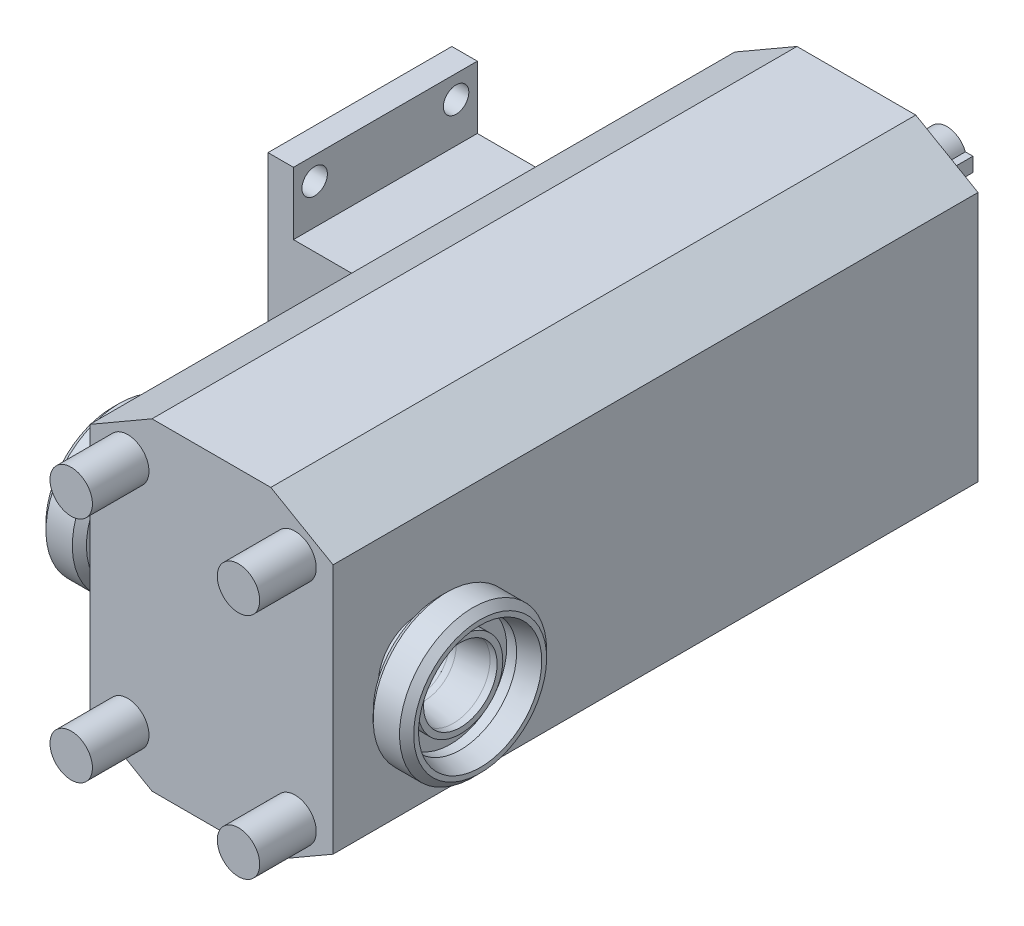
ISO-10303-21;
HEADER;
FILE_DESCRIPTION(('STEP AP214'),'2;1');
FILE_NAME('part.step','',(''),(''),'','','');
FILE_SCHEMA(('AUTOMOTIVE_DESIGN { 1 0 10303 214 1 1 1 1 }'));
ENDSEC;
DATA;
#1=APPLICATION_CONTEXT('core data for automotive mechanical design processes');
#2=APPLICATION_PROTOCOL_DEFINITION('international standard','automotive_design',2000,#1);
#3=PRODUCT_CONTEXT('',#1,'mechanical');
#4=PRODUCT('Part','Part','',(#3));
#5=PRODUCT_RELATED_PRODUCT_CATEGORY('part','',(#4));
#6=PRODUCT_DEFINITION_FORMATION('','',#4);
#7=PRODUCT_DEFINITION_CONTEXT('part definition',#1,'design');
#8=PRODUCT_DEFINITION('design','',#6,#7);
#9=PRODUCT_DEFINITION_SHAPE('','',#8);
#10=(LENGTH_UNIT() NAMED_UNIT(*) SI_UNIT(.MILLI.,.METRE.));
#11=(NAMED_UNIT(*) PLANE_ANGLE_UNIT() SI_UNIT($,.RADIAN.));
#12=(NAMED_UNIT(*) SI_UNIT($,.STERADIAN.) SOLID_ANGLE_UNIT());
#13=UNCERTAINTY_MEASURE_WITH_UNIT(LENGTH_MEASURE(1.E-05),#10,'distance_accuracy_value','');
#14=(GEOMETRIC_REPRESENTATION_CONTEXT(3) GLOBAL_UNCERTAINTY_ASSIGNED_CONTEXT((#13)) GLOBAL_UNIT_ASSIGNED_CONTEXT((#10,
#11,#12)) REPRESENTATION_CONTEXT('',''));
#15=CARTESIAN_POINT('',(0.,0.,0.));
#16=DIRECTION('',(0.,0.,1.));
#17=DIRECTION('',(1.,0.,0.));
#18=AXIS2_PLACEMENT_3D('',#15,#16,#17);
#19=CARTESIAN_POINT('',(54.5,14.7786855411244,200.567187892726));
#20=DIRECTION('',(1.,0.,0.));
#21=DIRECTION('',(0.,0.171145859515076,-0.985245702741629));
#22=AXIS2_PLACEMENT_3D('',#19,#20,#21);
#23=PLANE('',#22);
#24=CARTESIAN_POINT('',(54.5,0.,198.));
#25=DIRECTION('',(-1.,0.,0.));
#26=DIRECTION('',(0.,-0.171145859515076,0.985245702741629));
#27=AXIS2_PLACEMENT_3D('',#24,#25,#26);
#28=CIRCLE('',#27,15.);
#29=CARTESIAN_POINT('',(54.5,-2.56718789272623,212.778685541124));
#30=VERTEX_POINT('',#29);
#31=EDGE_CURVE('P0_E67',#30,#30,#28,.T.);
#32=ORIENTED_EDGE('',*,*,#31,.T.);
#33=EDGE_LOOP('',(#32));
#34=FACE_BOUND('',#33,.T.);
#35=CARTESIAN_POINT('',(54.5,0.,198.));
#36=DIRECTION('',(-1.,0.,0.));
#37=DIRECTION('',(0.,-0.171145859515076,0.985245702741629));
#38=AXIS2_PLACEMENT_3D('',#35,#36,#37);
#39=CIRCLE('',#38,19.9);
#40=CARTESIAN_POINT('',(54.5,-3.4058026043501,217.606389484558));
#41=VERTEX_POINT('',#40);
#42=EDGE_CURVE('P0_E10',#41,#41,#39,.T.);
#43=ORIENTED_EDGE('',*,*,#42,.F.);
#44=EDGE_LOOP('',(#43));
#45=FACE_BOUND('',#44,.T.);
#46=ADVANCED_FACE('P0_F15',(#34,#45),#23,.T.);
#47=CARTESIAN_POINT('',(43.,0.,198.));
#48=DIRECTION('',(-1.,0.,0.));
#49=DIRECTION('',(0.,-0.171145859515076,0.985245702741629));
#50=AXIS2_PLACEMENT_3D('',#47,#48,#49);
#51=CYLINDRICAL_SURFACE('',#50,19.9);
#52=ORIENTED_EDGE('',*,*,#42,.T.);
#53=EDGE_LOOP('',(#52));
#54=FACE_BOUND('',#53,.T.);
#55=CARTESIAN_POINT('',(58.,0.,198.));
#56=DIRECTION('',(-1.,0.,0.));
#57=DIRECTION('',(0.,-0.171145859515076,0.985245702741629));
#58=AXIS2_PLACEMENT_3D('',#55,#56,#57);
#59=CIRCLE('',#58,19.9);
#60=CARTESIAN_POINT('',(58.,-3.4058026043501,217.606389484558));
#61=VERTEX_POINT('',#60);
#62=EDGE_CURVE('P0_E21',#61,#61,#59,.T.);
#63=ORIENTED_EDGE('',*,*,#62,.F.);
#64=EDGE_LOOP('',(#63));
#65=FACE_BOUND('',#64,.T.);
#66=ADVANCED_FACE('P0_F86',(#54,#65),#51,.F.);
#67=CARTESIAN_POINT('',(65.,0.,198.));
#68=DIRECTION('',(1.,0.,0.));
#69=DIRECTION('',(0.,0.171145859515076,-0.985245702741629));
#70=AXIS2_PLACEMENT_3D('',#67,#68,#69);
#71=CONICAL_SURFACE('',#70,21.7756443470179,0.26179938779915);
#72=ORIENTED_EDGE('',*,*,#62,.T.);
#73=EDGE_LOOP('',(#72));
#74=FACE_BOUND('',#73,.T.);
#75=CARTESIAN_POINT('',(65.,0.,198.));
#76=DIRECTION('',(-1.,0.,0.));
#77=DIRECTION('',(0.,-0.171145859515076,0.985245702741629));
#78=AXIS2_PLACEMENT_3D('',#75,#76,#77);
#79=CIRCLE('',#78,21.7756443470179);
#80=CARTESIAN_POINT('',(65.,-3.72681136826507,219.454360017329));
#81=VERTEX_POINT('',#80);
#82=EDGE_CURVE('P0_E25',#81,#81,#79,.T.);
#83=ORIENTED_EDGE('',*,*,#82,.F.);
#84=EDGE_LOOP('',(#83));
#85=FACE_BOUND('',#84,.T.);
#86=ADVANCED_FACE('P0_F90',(#74,#85),#71,.F.);
#87=CARTESIAN_POINT('',(65.,21.4543600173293,201.726811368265));
#88=DIRECTION('',(1.,0.,0.));
#89=DIRECTION('',(0.,0.171145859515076,-0.985245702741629));
#90=AXIS2_PLACEMENT_3D('',#87,#88,#89);
#91=PLANE('',#90);
#92=ORIENTED_EDGE('',*,*,#82,.T.);
#93=EDGE_LOOP('',(#92));
#94=FACE_BOUND('',#93,.T.);
#95=CARTESIAN_POINT('',(65.,0.,198.));
#96=DIRECTION('',(-1.,0.,0.));
#97=DIRECTION('',(0.,-0.171145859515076,0.985245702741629));
#98=AXIS2_PLACEMENT_3D('',#95,#96,#97);
#99=CIRCLE('',#98,23.5);
#100=CARTESIAN_POINT('',(65.,-4.02192769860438,221.153274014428));
#101=VERTEX_POINT('',#100);
#102=EDGE_CURVE('P0_E29',#101,#101,#99,.T.);
#103=ORIENTED_EDGE('',*,*,#102,.F.);
#104=EDGE_LOOP('',(#103));
#105=FACE_BOUND('',#104,.T.);
#106=ADVANCED_FACE('P0_F94',(#94,#105),#91,.T.);
#107=CARTESIAN_POINT('',(62.5,0.,198.));
#108=DIRECTION('',(-1.,0.,0.));
#109=DIRECTION('',(0.,-0.171145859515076,0.985245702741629));
#110=AXIS2_PLACEMENT_3D('',#107,#108,#109);
#111=CONICAL_SURFACE('',#110,26.,0.785398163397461);
#112=ORIENTED_EDGE('',*,*,#102,.T.);
#113=EDGE_LOOP('',(#112));
#114=FACE_BOUND('',#113,.T.);
#115=CARTESIAN_POINT('',(62.5,0.,198.));
#116=DIRECTION('',(-1.,0.,0.));
#117=DIRECTION('',(0.,-0.171145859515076,0.985245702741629));
#118=AXIS2_PLACEMENT_3D('',#115,#116,#117);
#119=CIRCLE('',#118,26.);
#120=CARTESIAN_POINT('',(62.5,-4.44979234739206,223.616388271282));
#121=VERTEX_POINT('',#120);
#122=EDGE_CURVE('P0_E34',#121,#121,#119,.T.);
#123=ORIENTED_EDGE('',*,*,#122,.F.);
#124=EDGE_LOOP('',(#123));
#125=FACE_BOUND('',#124,.T.);
#126=ADVANCED_FACE('P0_F100',(#114,#125),#111,.T.);
#127=CARTESIAN_POINT('',(43.,0.,198.));
#128=DIRECTION('',(-1.,0.,0.));
#129=DIRECTION('',(0.,-0.171145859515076,0.985245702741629));
#130=AXIS2_PLACEMENT_3D('',#127,#128,#129);
#131=CYLINDRICAL_SURFACE('',#130,26.);
#132=ORIENTED_EDGE('',*,*,#122,.T.);
#133=EDGE_LOOP('',(#132));
#134=FACE_BOUND('',#133,.T.);
#135=CARTESIAN_POINT('',(53.1751063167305,0.,198.));
#136=DIRECTION('',(-1.,0.,0.));
#137=DIRECTION('',(0.,-0.171145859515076,0.985245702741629));
#138=AXIS2_PLACEMENT_3D('',#135,#136,#137);
#139=CIRCLE('',#138,26.);
#140=CARTESIAN_POINT('',(53.1751063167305,-4.44979234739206,223.616388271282));
#141=VERTEX_POINT('',#140);
#142=EDGE_CURVE('P0_E37',#141,#141,#139,.T.);
#143=ORIENTED_EDGE('',*,*,#142,.F.);
#144=EDGE_LOOP('',(#143));
#145=FACE_BOUND('',#144,.T.);
#146=ADVANCED_FACE('P0_F104',(#134,#145),#131,.T.);
#147=CARTESIAN_POINT('',(50.6751063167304,0.,198.));
#148=DIRECTION('',(1.,0.,0.));
#149=DIRECTION('',(0.,0.171145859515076,-0.985245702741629));
#150=AXIS2_PLACEMENT_3D('',#147,#148,#149);
#151=CONICAL_SURFACE('',#150,23.5,0.785398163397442);
#152=ORIENTED_EDGE('',*,*,#142,.T.);
#153=EDGE_LOOP('',(#152));
#154=FACE_BOUND('',#153,.T.);
#155=CARTESIAN_POINT('',(50.6751063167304,0.,198.));
#156=DIRECTION('',(-1.,0.,0.));
#157=DIRECTION('',(0.,-0.171145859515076,0.985245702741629));
#158=AXIS2_PLACEMENT_3D('',#155,#156,#157);
#159=CIRCLE('',#158,23.5);
#160=CARTESIAN_POINT('',(50.6751063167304,-4.02192769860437,221.153274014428));
#161=VERTEX_POINT('',#160);
#162=EDGE_CURVE('P0_E40',#161,#161,#159,.T.);
#163=ORIENTED_EDGE('',*,*,#162,.F.);
#164=EDGE_LOOP('',(#163));
#165=FACE_BOUND('',#164,.T.);
#166=ADVANCED_FACE('P0_F108',(#154,#165),#151,.T.);
#167=CARTESIAN_POINT('',(49.3642703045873,0.,198.));
#168=DIRECTION('',(1.,0.,0.));
#169=DIRECTION('',(0.,0.171145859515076,-0.985245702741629));
#170=AXIS2_PLACEMENT_3D('',#167,#168,#169);
#171=CONICAL_SURFACE('',#170,16.0658795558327,1.39626340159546);
#172=ORIENTED_EDGE('',*,*,#162,.T.);
#173=EDGE_LOOP('',(#172));
#174=FACE_BOUND('',#173,.T.);
#175=CARTESIAN_POINT('',(49.3642703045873,0.,198.));
#176=DIRECTION('',(-1.,0.,0.));
#177=DIRECTION('',(0.,-0.171145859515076,0.985245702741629));
#178=AXIS2_PLACEMENT_3D('',#175,#176,#177);
#179=CIRCLE('',#178,16.0658795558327);
#180=CARTESIAN_POINT('',(49.3642703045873,-2.74960876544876,213.828838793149));
#181=VERTEX_POINT('',#180);
#182=EDGE_CURVE('P0_E43',#181,#181,#179,.T.);
#183=ORIENTED_EDGE('',*,*,#182,.F.);
#184=EDGE_LOOP('',(#183));
#185=FACE_BOUND('',#184,.T.);
#186=ADVANCED_FACE('P0_F112',(#174,#185),#171,.T.);
#187=CARTESIAN_POINT('',(46.9022509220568,0.,198.));
#188=DIRECTION('',(-1.,0.,0.));
#189=DIRECTION('',(0.,-0.171145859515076,0.985245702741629));
#190=AXIS2_PLACEMENT_3D('',#187,#188,#189);
#191=TOROIDAL_SURFACE('',#190,16.5,2.5);
#192=ORIENTED_EDGE('',*,*,#182,.T.);
#193=EDGE_LOOP('',(#192));
#194=FACE_BOUND('',#193,.T.);
#195=CARTESIAN_POINT('',(46.9022509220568,0.,198.));
#196=DIRECTION('',(-1.,0.,0.));
#197=DIRECTION('',(0.,-0.171145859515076,0.985245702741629));
#198=AXIS2_PLACEMENT_3D('',#195,#196,#197);
#199=CIRCLE('',#198,14.);
#200=CARTESIAN_POINT('',(46.9022509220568,-2.39604203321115,211.793439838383));
#201=VERTEX_POINT('',#200);
#202=EDGE_CURVE('P0_E46',#201,#201,#199,.T.);
#203=ORIENTED_EDGE('',*,*,#202,.F.);
#204=EDGE_LOOP('',(#203));
#205=FACE_BOUND('',#204,.T.);
#206=ADVANCED_FACE('P0_F116',(#194,#205),#191,.F.);
#207=CARTESIAN_POINT('',(43.,0.,198.));
#208=DIRECTION('',(-1.,0.,0.));
#209=DIRECTION('',(0.,-0.171145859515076,0.985245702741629));
#210=AXIS2_PLACEMENT_3D('',#207,#208,#209);
#211=CYLINDRICAL_SURFACE('',#210,14.);
#212=ORIENTED_EDGE('',*,*,#202,.T.);
#213=EDGE_LOOP('',(#212));
#214=FACE_BOUND('',#213,.T.);
#215=CARTESIAN_POINT('',(43.,0.,198.));
#216=DIRECTION('',(-1.,0.,0.));
#217=DIRECTION('',(0.,-0.171145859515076,0.985245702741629));
#218=AXIS2_PLACEMENT_3D('',#215,#216,#217);
#219=CIRCLE('',#218,14.);
#220=CARTESIAN_POINT('',(43.,-2.39604203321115,211.793439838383));
#221=VERTEX_POINT('',#220);
#222=EDGE_CURVE('P0_E49',#221,#221,#219,.T.);
#223=ORIENTED_EDGE('',*,*,#222,.F.);
#224=EDGE_LOOP('',(#223));
#225=FACE_BOUND('',#224,.T.);
#226=ADVANCED_FACE('P0_F120',(#214,#225),#211,.T.);
#227=CARTESIAN_POINT('',(43.,11.0347518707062,199.916833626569));
#228=DIRECTION('',(-1.,0.,0.));
#229=DIRECTION('',(0.,-0.171145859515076,0.985245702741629));
#230=AXIS2_PLACEMENT_3D('',#227,#228,#229);
#231=PLANE('',#230);
#232=ORIENTED_EDGE('',*,*,#222,.T.);
#233=EDGE_LOOP('',(#232));
#234=FACE_BOUND('',#233,.T.);
#235=CARTESIAN_POINT('',(43.,0.,198.));
#236=DIRECTION('',(-1.,0.,0.));
#237=DIRECTION('',(0.,-0.171145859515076,0.985245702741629));
#238=AXIS2_PLACEMENT_3D('',#235,#236,#237);
#239=CIRCLE('',#238,11.2);
#240=CARTESIAN_POINT('',(43.,-1.91683362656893,209.034751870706));
#241=VERTEX_POINT('',#240);
#242=EDGE_CURVE('P0_E52',#241,#241,#239,.T.);
#243=ORIENTED_EDGE('',*,*,#242,.F.);
#244=EDGE_LOOP('',(#243));
#245=FACE_BOUND('',#244,.T.);
#246=ADVANCED_FACE('P0_F124',(#234,#245),#231,.T.);
#247=CARTESIAN_POINT('',(43.,0.,198.));
#248=DIRECTION('',(-1.,0.,0.));
#249=DIRECTION('',(0.,-0.171145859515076,0.985245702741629));
#250=AXIS2_PLACEMENT_3D('',#247,#248,#249);
#251=CYLINDRICAL_SURFACE('',#250,11.2);
#252=ORIENTED_EDGE('',*,*,#242,.T.);
#253=EDGE_LOOP('',(#252));
#254=FACE_BOUND('',#253,.T.);
#255=CARTESIAN_POINT('',(45.2916927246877,0.,198.));
#256=DIRECTION('',(-1.,0.,0.));
#257=DIRECTION('',(0.,-0.171145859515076,0.985245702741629));
#258=AXIS2_PLACEMENT_3D('',#255,#256,#257);
#259=CIRCLE('',#258,11.2);
#260=CARTESIAN_POINT('',(45.2916927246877,-1.91683362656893,209.034751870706));
#261=VERTEX_POINT('',#260);
#262=EDGE_CURVE('P0_E55',#261,#261,#259,.T.);
#263=ORIENTED_EDGE('',*,*,#262,.F.);
#264=EDGE_LOOP('',(#263));
#265=FACE_BOUND('',#264,.T.);
#266=ADVANCED_FACE('P0_F128',(#254,#265),#251,.F.);
#267=CARTESIAN_POINT('',(55.5,0.,198.));
#268=DIRECTION('',(1.,0.,0.));
#269=DIRECTION('',(0.,0.171145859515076,-0.985245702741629));
#270=AXIS2_PLACEMENT_3D('',#267,#268,#269);
#271=CONICAL_SURFACE('',#270,13.,0.174532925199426);
#272=ORIENTED_EDGE('',*,*,#262,.T.);
#273=EDGE_LOOP('',(#272));
#274=FACE_BOUND('',#273,.T.);
#275=CARTESIAN_POINT('',(55.5,0.,198.));
#276=DIRECTION('',(-1.,0.,0.));
#277=DIRECTION('',(0.,-0.171145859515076,0.985245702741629));
#278=AXIS2_PLACEMENT_3D('',#275,#276,#277);
#279=CIRCLE('',#278,13.);
#280=CARTESIAN_POINT('',(55.5,-2.22489617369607,210.808194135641));
#281=VERTEX_POINT('',#280);
#282=EDGE_CURVE('P0_E58',#281,#281,#279,.T.);
#283=ORIENTED_EDGE('',*,*,#282,.F.);
#284=EDGE_LOOP('',(#283));
#285=FACE_BOUND('',#284,.T.);
#286=ADVANCED_FACE('P0_F132',(#274,#285),#271,.F.);
#287=CARTESIAN_POINT('',(43.,0.,198.));
#288=DIRECTION('',(-1.,0.,0.));
#289=DIRECTION('',(0.,-0.171145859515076,0.985245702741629));
#290=AXIS2_PLACEMENT_3D('',#287,#288,#289);
#291=CYLINDRICAL_SURFACE('',#290,13.);
#292=ORIENTED_EDGE('',*,*,#282,.T.);
#293=EDGE_LOOP('',(#292));
#294=FACE_BOUND('',#293,.T.);
#295=CARTESIAN_POINT('',(58.,0.,198.));
#296=DIRECTION('',(-1.,0.,0.));
#297=DIRECTION('',(0.,-0.171145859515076,0.985245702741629));
#298=AXIS2_PLACEMENT_3D('',#295,#296,#297);
#299=CIRCLE('',#298,13.);
#300=CARTESIAN_POINT('',(58.,-2.22489617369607,210.808194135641));
#301=VERTEX_POINT('',#300);
#302=EDGE_CURVE('P0_E61',#301,#301,#299,.T.);
#303=ORIENTED_EDGE('',*,*,#302,.F.);
#304=EDGE_LOOP('',(#303));
#305=FACE_BOUND('',#304,.T.);
#306=ADVANCED_FACE('P0_F82',(#294,#305),#291,.F.);
#307=CARTESIAN_POINT('',(58.,12.8081941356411,200.224896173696));
#308=DIRECTION('',(1.,0.,0.));
#309=DIRECTION('',(0.,0.171145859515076,-0.985245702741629));
#310=AXIS2_PLACEMENT_3D('',#307,#308,#309);
#311=PLANE('',#310);
#312=ORIENTED_EDGE('',*,*,#302,.T.);
#313=EDGE_LOOP('',(#312));
#314=FACE_BOUND('',#313,.T.);
#315=CARTESIAN_POINT('',(58.,0.,198.));
#316=DIRECTION('',(-1.,0.,0.));
#317=DIRECTION('',(0.,-0.171145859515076,0.985245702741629));
#318=AXIS2_PLACEMENT_3D('',#315,#316,#317);
#319=CIRCLE('',#318,15.);
#320=CARTESIAN_POINT('',(58.,-2.56718789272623,212.778685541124));
#321=VERTEX_POINT('',#320);
#322=EDGE_CURVE('P0_E64',#321,#321,#319,.T.);
#323=ORIENTED_EDGE('',*,*,#322,.F.);
#324=EDGE_LOOP('',(#323));
#325=FACE_BOUND('',#324,.T.);
#326=ADVANCED_FACE('P0_F75',(#314,#325),#311,.T.);
#327=CARTESIAN_POINT('',(43.,0.,198.));
#328=DIRECTION('',(-1.,0.,0.));
#329=DIRECTION('',(0.,-0.171145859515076,0.985245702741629));
#330=AXIS2_PLACEMENT_3D('',#327,#328,#329);
#331=CYLINDRICAL_SURFACE('',#330,15.);
#332=ORIENTED_EDGE('',*,*,#322,.T.);
#333=EDGE_LOOP('',(#332));
#334=FACE_BOUND('',#333,.T.);
#335=ORIENTED_EDGE('',*,*,#31,.F.);
#336=EDGE_LOOP('',(#335));
#337=FACE_BOUND('',#336,.T.);
#338=ADVANCED_FACE('P0_F73',(#334,#337),#331,.T.);
#339=CLOSED_SHELL('',(#46,#66,#86,#106,#126,#146,#166,#186,#206,#226,#246,#266,#286,#306,#326,#338));
#340=MANIFOLD_SOLID_BREP('P0_B1',#339);
#341=CARTESIAN_POINT('',(-54.5,12.4071669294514,206.429840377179));
#342=DIRECTION('',(-1.,0.,0.));
#343=DIRECTION('',(0.,-0.561989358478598,0.827144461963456));
#344=AXIS2_PLACEMENT_3D('',#341,#342,#343);
#345=PLANE('',#344);
#346=CARTESIAN_POINT('',(-54.5,-3.95888872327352E-13,198.));
#347=DIRECTION('',(1.,0.,0.));
#348=DIRECTION('',(0.,0.561989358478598,-0.827144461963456));
#349=AXIS2_PLACEMENT_3D('',#346,#347,#348);
#350=CIRCLE('',#349,15.);
#351=CARTESIAN_POINT('',(-54.5,8.42984037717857,185.592833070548));
#352=VERTEX_POINT('',#351);
#353=EDGE_CURVE('P1_E66',#352,#352,#350,.T.);
#354=ORIENTED_EDGE('',*,*,#353,.T.);
#355=EDGE_LOOP('',(#354));
#356=FACE_BOUND('',#355,.T.);
#357=CARTESIAN_POINT('',(-54.5,-3.95888872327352E-13,198.));
#358=DIRECTION('',(1.,0.,0.));
#359=DIRECTION('',(0.,0.561989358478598,-0.827144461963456));
#360=AXIS2_PLACEMENT_3D('',#357,#358,#359);
#361=CIRCLE('',#360,19.9);
#362=CARTESIAN_POINT('',(-54.5,11.1835882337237,181.539825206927));
#363=VERTEX_POINT('',#362);
#364=EDGE_CURVE('P1_E9',#363,#363,#361,.T.);
#365=ORIENTED_EDGE('',*,*,#364,.F.);
#366=EDGE_LOOP('',(#365));
#367=FACE_BOUND('',#366,.T.);
#368=ADVANCED_FACE('P1_F14',(#356,#367),#345,.T.);
#369=CARTESIAN_POINT('',(-43.,-3.93735655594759E-13,198.));
#370=DIRECTION('',(1.,0.,0.));
#371=DIRECTION('',(0.,0.561989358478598,-0.827144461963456));
#372=AXIS2_PLACEMENT_3D('',#369,#370,#371);
#373=CYLINDRICAL_SURFACE('',#372,19.9);
#374=ORIENTED_EDGE('',*,*,#364,.T.);
#375=EDGE_LOOP('',(#374));
#376=FACE_BOUND('',#375,.T.);
#377=CARTESIAN_POINT('',(-58.,-3.96544199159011E-13,198.));
#378=DIRECTION('',(1.,0.,0.));
#379=DIRECTION('',(0.,0.561989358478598,-0.827144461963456));
#380=AXIS2_PLACEMENT_3D('',#377,#378,#379);
#381=CIRCLE('',#380,19.9);
#382=CARTESIAN_POINT('',(-58.,11.1835882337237,181.539825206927));
#383=VERTEX_POINT('',#382);
#384=EDGE_CURVE('P1_E20',#383,#383,#381,.T.);
#385=ORIENTED_EDGE('',*,*,#384,.F.);
#386=EDGE_LOOP('',(#385));
#387=FACE_BOUND('',#386,.T.);
#388=ADVANCED_FACE('P1_F85',(#376,#387),#373,.F.);
#389=CARTESIAN_POINT('',(-65.,-3.97854852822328E-13,198.));
#390=DIRECTION('',(-1.,0.,0.));
#391=DIRECTION('',(0.,-0.561989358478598,0.827144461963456));
#392=AXIS2_PLACEMENT_3D('',#389,#390,#391);
#393=CONICAL_SURFACE('',#392,21.7756443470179,0.26179938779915);
#394=ORIENTED_EDGE('',*,*,#384,.T.);
#395=EDGE_LOOP('',(#394));
#396=FACE_BOUND('',#395,.T.);
#397=CARTESIAN_POINT('',(-65.,-3.97854852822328E-13,198.));
#398=DIRECTION('',(1.,0.,0.));
#399=DIRECTION('',(0.,0.561989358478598,-0.827144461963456));
#400=AXIS2_PLACEMENT_3D('',#397,#398,#399);
#401=CIRCLE('',#400,21.7756443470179);
#402=CARTESIAN_POINT('',(-65.,12.2376803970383,179.988396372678));
#403=VERTEX_POINT('',#402);
#404=EDGE_CURVE('P1_E24',#403,#403,#401,.T.);
#405=ORIENTED_EDGE('',*,*,#404,.F.);
#406=EDGE_LOOP('',(#405));
#407=FACE_BOUND('',#406,.T.);
#408=ADVANCED_FACE('P1_F89',(#396,#407),#393,.F.);
#409=CARTESIAN_POINT('',(-65.,18.0116036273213,210.237680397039));
#410=DIRECTION('',(-1.,0.,0.));
#411=DIRECTION('',(0.,-0.561989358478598,0.827144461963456));
#412=AXIS2_PLACEMENT_3D('',#409,#410,#411);
#413=PLANE('',#412);
#414=ORIENTED_EDGE('',*,*,#404,.T.);
#415=EDGE_LOOP('',(#414));
#416=FACE_BOUND('',#415,.T.);
#417=CARTESIAN_POINT('',(-65.,-3.97854852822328E-13,198.));
#418=DIRECTION('',(1.,0.,0.));
#419=DIRECTION('',(0.,0.561989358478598,-0.827144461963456));
#420=AXIS2_PLACEMENT_3D('',#417,#418,#419);
#421=CIRCLE('',#420,23.5);
#422=CARTESIAN_POINT('',(-65.,13.2067499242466,178.562105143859));
#423=VERTEX_POINT('',#422);
#424=EDGE_CURVE('P1_E28',#423,#423,#421,.T.);
#425=ORIENTED_EDGE('',*,*,#424,.F.);
#426=EDGE_LOOP('',(#425));
#427=FACE_BOUND('',#426,.T.);
#428=ADVANCED_FACE('P1_F93',(#416,#427),#413,.T.);
#429=CARTESIAN_POINT('',(-62.5000000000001,-3.97386762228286E-13,198.));
#430=DIRECTION('',(1.,0.,0.));
#431=DIRECTION('',(0.,0.561989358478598,-0.827144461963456));
#432=AXIS2_PLACEMENT_3D('',#429,#430,#431);
#433=CONICAL_SURFACE('',#432,26.,0.785398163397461);
#434=ORIENTED_EDGE('',*,*,#424,.T.);
#435=EDGE_LOOP('',(#434));
#436=FACE_BOUND('',#435,.T.);
#437=CARTESIAN_POINT('',(-62.5000000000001,-3.97386762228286E-13,198.));
#438=DIRECTION('',(1.,0.,0.));
#439=DIRECTION('',(0.,0.561989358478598,-0.827144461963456));
#440=AXIS2_PLACEMENT_3D('',#437,#438,#439);
#441=CIRCLE('',#440,26.);
#442=CARTESIAN_POINT('',(-62.5000000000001,14.6117233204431,176.49424398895));
#443=VERTEX_POINT('',#442);
#444=EDGE_CURVE('P1_E33',#443,#443,#441,.T.);
#445=ORIENTED_EDGE('',*,*,#444,.F.);
#446=EDGE_LOOP('',(#445));
#447=FACE_BOUND('',#446,.T.);
#448=ADVANCED_FACE('P1_F99',(#436,#447),#433,.T.);
#449=CARTESIAN_POINT('',(-43.,-3.93735655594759E-13,198.));
#450=DIRECTION('',(1.,0.,0.));
#451=DIRECTION('',(0.,0.561989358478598,-0.827144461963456));
#452=AXIS2_PLACEMENT_3D('',#449,#450,#451);
#453=CYLINDRICAL_SURFACE('',#452,26.);
#454=ORIENTED_EDGE('',*,*,#444,.T.);
#455=EDGE_LOOP('',(#454));
#456=FACE_BOUND('',#455,.T.);
#457=CARTESIAN_POINT('',(-53.1751063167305,-3.95640804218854E-13,198.));
#458=DIRECTION('',(1.,0.,0.));
#459=DIRECTION('',(0.,0.561989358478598,-0.827144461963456));
#460=AXIS2_PLACEMENT_3D('',#457,#458,#459);
#461=CIRCLE('',#460,26.);
#462=CARTESIAN_POINT('',(-53.1751063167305,14.6117233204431,176.49424398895));
#463=VERTEX_POINT('',#462);
#464=EDGE_CURVE('P1_E36',#463,#463,#461,.T.);
#465=ORIENTED_EDGE('',*,*,#464,.F.);
#466=EDGE_LOOP('',(#465));
#467=FACE_BOUND('',#466,.T.);
#468=ADVANCED_FACE('P1_F103',(#456,#467),#453,.T.);
#469=CARTESIAN_POINT('',(-50.6751063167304,-3.95172713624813E-13,198.));
#470=DIRECTION('',(-1.,0.,0.));
#471=DIRECTION('',(0.,-0.561989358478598,0.827144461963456));
#472=AXIS2_PLACEMENT_3D('',#469,#470,#471);
#473=CONICAL_SURFACE('',#472,23.5,0.785398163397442);
#474=ORIENTED_EDGE('',*,*,#464,.T.);
#475=EDGE_LOOP('',(#474));
#476=FACE_BOUND('',#475,.T.);
#477=CARTESIAN_POINT('',(-50.6751063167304,-3.95172713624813E-13,198.));
#478=DIRECTION('',(1.,0.,0.));
#479=DIRECTION('',(0.,0.561989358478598,-0.827144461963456));
#480=AXIS2_PLACEMENT_3D('',#477,#478,#479);
#481=CIRCLE('',#480,23.5);
#482=CARTESIAN_POINT('',(-50.6751063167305,13.2067499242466,178.562105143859));
#483=VERTEX_POINT('',#482);
#484=EDGE_CURVE('P1_E39',#483,#483,#481,.T.);
#485=ORIENTED_EDGE('',*,*,#484,.F.);
#486=EDGE_LOOP('',(#485));
#487=FACE_BOUND('',#486,.T.);
#488=ADVANCED_FACE('P1_F107',(#476,#487),#473,.T.);
#489=CARTESIAN_POINT('',(-49.3642703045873,-3.94927277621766E-13,198.));
#490=DIRECTION('',(-1.,0.,0.));
#491=DIRECTION('',(0.,-0.561989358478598,0.827144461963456));
#492=AXIS2_PLACEMENT_3D('',#489,#490,#491);
#493=CONICAL_SURFACE('',#492,16.0658795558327,1.39626340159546);
#494=ORIENTED_EDGE('',*,*,#484,.T.);
#495=EDGE_LOOP('',(#494));
#496=FACE_BOUND('',#495,.T.);
#497=CARTESIAN_POINT('',(-49.3642703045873,-3.94927277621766E-13,198.));
#498=DIRECTION('',(1.,0.,0.));
#499=DIRECTION('',(0.,0.561989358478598,-0.827144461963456));
#500=AXIS2_PLACEMENT_3D('',#497,#498,#499);
#501=CIRCLE('',#500,16.0658795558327);
#502=CARTESIAN_POINT('',(-49.3642703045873,9.02885334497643,184.711196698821));
#503=VERTEX_POINT('',#502);
#504=EDGE_CURVE('P1_E42',#503,#503,#501,.T.);
#505=ORIENTED_EDGE('',*,*,#504,.F.);
#506=EDGE_LOOP('',(#505));
#507=FACE_BOUND('',#506,.T.);
#508=ADVANCED_FACE('P1_F111',(#496,#507),#493,.T.);
#509=CARTESIAN_POINT('',(-46.9022509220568,-3.94466298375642E-13,198.));
#510=DIRECTION('',(1.,0.,0.));
#511=DIRECTION('',(0.,0.561989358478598,-0.827144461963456));
#512=AXIS2_PLACEMENT_3D('',#509,#510,#511);
#513=TOROIDAL_SURFACE('',#512,16.5,2.5);
#514=ORIENTED_EDGE('',*,*,#504,.T.);
#515=EDGE_LOOP('',(#514));
#516=FACE_BOUND('',#515,.T.);
#517=CARTESIAN_POINT('',(-46.9022509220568,-3.94466298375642E-13,198.));
#518=DIRECTION('',(1.,0.,0.));
#519=DIRECTION('',(0.,0.561989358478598,-0.827144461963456));
#520=AXIS2_PLACEMENT_3D('',#517,#518,#519);
#521=CIRCLE('',#520,14.);
#522=CARTESIAN_POINT('',(-46.9022509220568,7.86785101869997,186.419977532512));
#523=VERTEX_POINT('',#522);
#524=EDGE_CURVE('P1_E45',#523,#523,#521,.T.);
#525=ORIENTED_EDGE('',*,*,#524,.F.);
#526=EDGE_LOOP('',(#525));
#527=FACE_BOUND('',#526,.T.);
#528=ADVANCED_FACE('P1_F115',(#516,#527),#513,.F.);
#529=CARTESIAN_POINT('',(-43.,-3.93735655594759E-13,198.));
#530=DIRECTION('',(1.,0.,0.));
#531=DIRECTION('',(0.,0.561989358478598,-0.827144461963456));
#532=AXIS2_PLACEMENT_3D('',#529,#530,#531);
#533=CYLINDRICAL_SURFACE('',#532,14.);
#534=ORIENTED_EDGE('',*,*,#524,.T.);
#535=EDGE_LOOP('',(#534));
#536=FACE_BOUND('',#535,.T.);
#537=CARTESIAN_POINT('',(-43.,-3.93735655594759E-13,198.));
#538=DIRECTION('',(1.,0.,0.));
#539=DIRECTION('',(0.,0.561989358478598,-0.827144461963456));
#540=AXIS2_PLACEMENT_3D('',#537,#538,#539);
#541=CIRCLE('',#540,14.);
#542=CARTESIAN_POINT('',(-43.,7.86785101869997,186.419977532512));
#543=VERTEX_POINT('',#542);
#544=EDGE_CURVE('P1_E48',#543,#543,#541,.T.);
#545=ORIENTED_EDGE('',*,*,#544,.F.);
#546=EDGE_LOOP('',(#545));
#547=FACE_BOUND('',#546,.T.);
#548=ADVANCED_FACE('P1_F119',(#536,#547),#533,.T.);
#549=CARTESIAN_POINT('',(-43.,9.26401797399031,204.29428081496));
#550=DIRECTION('',(1.,0.,0.));
#551=DIRECTION('',(0.,0.561989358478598,-0.827144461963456));
#552=AXIS2_PLACEMENT_3D('',#549,#550,#551);
#553=PLANE('',#552);
#554=ORIENTED_EDGE('',*,*,#544,.T.);
#555=EDGE_LOOP('',(#554));
#556=FACE_BOUND('',#555,.T.);
#557=CARTESIAN_POINT('',(-43.,-3.93735655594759E-13,198.));
#558=DIRECTION('',(1.,0.,0.));
#559=DIRECTION('',(0.,0.561989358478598,-0.827144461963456));
#560=AXIS2_PLACEMENT_3D('',#557,#558,#559);
#561=CIRCLE('',#560,11.2);
#562=CARTESIAN_POINT('',(-43.,6.2942808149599,188.735982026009));
#563=VERTEX_POINT('',#562);
#564=EDGE_CURVE('P1_E51',#563,#563,#561,.T.);
#565=ORIENTED_EDGE('',*,*,#564,.F.);
#566=EDGE_LOOP('',(#565));
#567=FACE_BOUND('',#566,.T.);
#568=ADVANCED_FACE('P1_F123',(#556,#567),#553,.T.);
#569=CARTESIAN_POINT('',(-43.,-3.93735655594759E-13,198.));
#570=DIRECTION('',(1.,0.,0.));
#571=DIRECTION('',(0.,0.561989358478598,-0.827144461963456));
#572=AXIS2_PLACEMENT_3D('',#569,#570,#571);
#573=CYLINDRICAL_SURFACE('',#572,11.2);
#574=ORIENTED_EDGE('',*,*,#564,.T.);
#575=EDGE_LOOP('',(#574));
#576=FACE_BOUND('',#575,.T.);
#577=CARTESIAN_POINT('',(-45.2916927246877,-3.94164743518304E-13,198.));
#578=DIRECTION('',(1.,0.,0.));
#579=DIRECTION('',(0.,0.561989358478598,-0.827144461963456));
#580=AXIS2_PLACEMENT_3D('',#577,#578,#579);
#581=CIRCLE('',#580,11.2);
#582=CARTESIAN_POINT('',(-45.2916927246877,6.2942808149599,188.735982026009));
#583=VERTEX_POINT('',#582);
#584=EDGE_CURVE('P1_E54',#583,#583,#581,.T.);
#585=ORIENTED_EDGE('',*,*,#584,.F.);
#586=EDGE_LOOP('',(#585));
#587=FACE_BOUND('',#586,.T.);
#588=ADVANCED_FACE('P1_F127',(#576,#587),#573,.F.);
#589=CARTESIAN_POINT('',(-55.5,-3.96076108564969E-13,198.));
#590=DIRECTION('',(-1.,0.,0.));
#591=DIRECTION('',(0.,-0.561989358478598,0.827144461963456));
#592=AXIS2_PLACEMENT_3D('',#589,#590,#591);
#593=CONICAL_SURFACE('',#592,13.,0.174532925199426);
#594=ORIENTED_EDGE('',*,*,#584,.T.);
#595=EDGE_LOOP('',(#594));
#596=FACE_BOUND('',#595,.T.);
#597=CARTESIAN_POINT('',(-55.5,-3.96076108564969E-13,198.));
#598=DIRECTION('',(1.,0.,0.));
#599=DIRECTION('',(0.,0.561989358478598,-0.827144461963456));
#600=AXIS2_PLACEMENT_3D('',#597,#598,#599);
#601=CIRCLE('',#600,13.);
#602=CARTESIAN_POINT('',(-55.5,7.30586166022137,187.247121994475));
#603=VERTEX_POINT('',#602);
#604=EDGE_CURVE('P1_E57',#603,#603,#601,.T.);
#605=ORIENTED_EDGE('',*,*,#604,.F.);
#606=EDGE_LOOP('',(#605));
#607=FACE_BOUND('',#606,.T.);
#608=ADVANCED_FACE('P1_F131',(#596,#607),#593,.F.);
#609=CARTESIAN_POINT('',(-43.,-3.93735655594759E-13,198.));
#610=DIRECTION('',(1.,0.,0.));
#611=DIRECTION('',(0.,0.561989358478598,-0.827144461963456));
#612=AXIS2_PLACEMENT_3D('',#609,#610,#611);
#613=CYLINDRICAL_SURFACE('',#612,13.);
#614=ORIENTED_EDGE('',*,*,#604,.T.);
#615=EDGE_LOOP('',(#614));
#616=FACE_BOUND('',#615,.T.);
#617=CARTESIAN_POINT('',(-58.,-3.96544199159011E-13,198.));
#618=DIRECTION('',(1.,0.,0.));
#619=DIRECTION('',(0.,0.561989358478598,-0.827144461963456));
#620=AXIS2_PLACEMENT_3D('',#617,#618,#619);
#621=CIRCLE('',#620,13.);
#622=CARTESIAN_POINT('',(-58.,7.30586166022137,187.247121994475));
#623=VERTEX_POINT('',#622);
#624=EDGE_CURVE('P1_E60',#623,#623,#621,.T.);
#625=ORIENTED_EDGE('',*,*,#624,.F.);
#626=EDGE_LOOP('',(#625));
#627=FACE_BOUND('',#626,.T.);
#628=ADVANCED_FACE('P1_F81',(#616,#627),#613,.F.);
#629=CARTESIAN_POINT('',(-58.,10.7528780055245,205.305861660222));
#630=DIRECTION('',(-1.,0.,0.));
#631=DIRECTION('',(0.,-0.561989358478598,0.827144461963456));
#632=AXIS2_PLACEMENT_3D('',#629,#630,#631);
#633=PLANE('',#632);
#634=ORIENTED_EDGE('',*,*,#624,.T.);
#635=EDGE_LOOP('',(#634));
#636=FACE_BOUND('',#635,.T.);
#637=CARTESIAN_POINT('',(-58.,-3.96544199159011E-13,198.));
#638=DIRECTION('',(1.,0.,0.));
#639=DIRECTION('',(0.,0.561989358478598,-0.827144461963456));
#640=AXIS2_PLACEMENT_3D('',#637,#638,#639);
#641=CIRCLE('',#640,15.);
#642=CARTESIAN_POINT('',(-58.,8.42984037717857,185.592833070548));
#643=VERTEX_POINT('',#642);
#644=EDGE_CURVE('P1_E63',#643,#643,#641,.T.);
#645=ORIENTED_EDGE('',*,*,#644,.F.);
#646=EDGE_LOOP('',(#645));
#647=FACE_BOUND('',#646,.T.);
#648=ADVANCED_FACE('P1_F74',(#636,#647),#633,.T.);
#649=CARTESIAN_POINT('',(-43.,-3.93735655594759E-13,198.));
#650=DIRECTION('',(1.,0.,0.));
#651=DIRECTION('',(0.,0.561989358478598,-0.827144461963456));
#652=AXIS2_PLACEMENT_3D('',#649,#650,#651);
#653=CYLINDRICAL_SURFACE('',#652,15.);
#654=ORIENTED_EDGE('',*,*,#644,.T.);
#655=EDGE_LOOP('',(#654));
#656=FACE_BOUND('',#655,.T.);
#657=ORIENTED_EDGE('',*,*,#353,.F.);
#658=EDGE_LOOP('',(#657));
#659=FACE_BOUND('',#658,.T.);
#660=ADVANCED_FACE('P1_F72',(#656,#659),#653,.T.);
#661=CLOSED_SHELL('',(#368,#388,#408,#428,#448,#468,#488,#508,#528,#548,#568,#588,#608,#628,
#648,#660));
#662=MANIFOLD_SOLID_BREP('P1_B1',#661);
#663=CARTESIAN_POINT('',(-43.,-44.2982940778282,228.));
#664=DIRECTION('',(1.,0.,0.));
#665=DIRECTION('',(0.,0.,-1.));
#666=AXIS2_PLACEMENT_3D('',#663,#664,#665);
#667=PLANE('',#666);
#668=DIRECTION('',(0.,-1.,0.));
#669=VECTOR('',#668,1.);
#670=CARTESIAN_POINT('',(-43.,-44.2982940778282,0.));
#671=LINE('',#670,#669);
#672=CARTESIAN_POINT('',(-43.,44.2982940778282,0.));
#673=VERTEX_POINT('',#672);
#674=CARTESIAN_POINT('',(-43.,-44.2982940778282,0.));
#675=VERTEX_POINT('',#674);
#676=EDGE_CURVE('P2_E290',#673,#675,#671,.T.);
#677=ORIENTED_EDGE('',*,*,#676,.T.);
#678=DIRECTION('',(0.,0.,-1.));
#679=VECTOR('',#678,1.);
#680=CARTESIAN_POINT('',(-43.,-44.2982940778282,228.));
#681=LINE('',#680,#679);
#682=CARTESIAN_POINT('',(-43.,-44.2982940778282,228.));
#683=VERTEX_POINT('',#682);
#684=EDGE_CURVE('P2_E320',#683,#675,#681,.T.);
#685=ORIENTED_EDGE('',*,*,#684,.F.);
#686=DIRECTION('',(0.,-1.,0.));
#687=VECTOR('',#686,1.);
#688=CARTESIAN_POINT('',(-43.,-44.2982940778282,228.));
#689=LINE('',#688,#687);
#690=CARTESIAN_POINT('',(-43.,44.2982940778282,228.));
#691=VERTEX_POINT('',#690);
#692=EDGE_CURVE('P2_E272',#691,#683,#689,.T.);
#693=ORIENTED_EDGE('',*,*,#692,.F.);
#694=DIRECTION('',(0.,0.,-1.));
#695=VECTOR('',#694,1.);
#696=CARTESIAN_POINT('',(-43.,44.2982940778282,228.));
#697=LINE('',#696,#695);
#698=EDGE_CURVE('P2_E323',#691,#673,#697,.T.);
#699=ORIENTED_EDGE('',*,*,#698,.T.);
#700=EDGE_LOOP('',(#677,#685,#693,#699));
#701=FACE_BOUND('',#700,.T.);
#702=CARTESIAN_POINT('',(-43.,0.,198.));
#703=DIRECTION('',(1.,0.,0.));
#704=DIRECTION('',(0.,1.,0.));
#705=AXIS2_PLACEMENT_3D('',#702,#703,#704);
#706=CIRCLE('',#705,11.2);
#707=CARTESIAN_POINT('',(-43.,11.2,198.));
#708=VERTEX_POINT('',#707);
#709=EDGE_CURVE('P2_E214',#708,#708,#706,.T.);
#710=ORIENTED_EDGE('',*,*,#709,.T.);
#711=EDGE_LOOP('',(#710));
#712=FACE_BOUND('',#711,.T.);
#713=DIRECTION('',(0.,-1.,0.));
#714=VECTOR('',#713,1.);
#715=CARTESIAN_POINT('',(-43.,-44.2982940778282,63.));
#716=LINE('',#715,#714);
#717=CARTESIAN_POINT('',(-43.,36.8601182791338,63.));
#718=VERTEX_POINT('',#717);
#719=CARTESIAN_POINT('',(-43.,-36.8601182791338,63.));
#720=VERTEX_POINT('',#719);
#721=EDGE_CURVE('P2_E11',#718,#720,#716,.T.);
#722=ORIENTED_EDGE('',*,*,#721,.F.);
#723=DIRECTION('',(0.,0.,-1.));
#724=VECTOR('',#723,1.);
#725=CARTESIAN_POINT('',(-43.,36.8601182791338,228.));
#726=LINE('',#725,#724);
#727=CARTESIAN_POINT('',(-43.,36.8601182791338,128.));
#728=VERTEX_POINT('',#727);
#729=EDGE_CURVE('P2_E570',#728,#718,#726,.T.);
#730=ORIENTED_EDGE('',*,*,#729,.F.);
#731=DIRECTION('',(0.,-1.,0.));
#732=VECTOR('',#731,1.);
#733=CARTESIAN_POINT('',(-43.,-44.2982940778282,128.));
#734=LINE('',#733,#732);
#735=CARTESIAN_POINT('',(-43.,-36.8601182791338,128.));
#736=VERTEX_POINT('',#735);
#737=EDGE_CURVE('P2_E343',#728,#736,#734,.T.);
#738=ORIENTED_EDGE('',*,*,#737,.T.);
#739=DIRECTION('',(0.,0.,1.));
#740=VECTOR('',#739,1.);
#741=CARTESIAN_POINT('',(-43.,-36.8601182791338,228.));
#742=LINE('',#741,#740);
#743=EDGE_CURVE('P2_E25',#720,#736,#742,.T.);
#744=ORIENTED_EDGE('',*,*,#743,.F.);
#745=EDGE_LOOP('',(#722,#730,#738,#744));
#746=FACE_BOUND('',#745,.T.);
#747=ADVANCED_FACE('P2_F17',(#701,#712,#746),#667,.F.);
#748=CARTESIAN_POINT('',(0.,20.,219.362441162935));
#749=DIRECTION('',(0.,0.,1.));
#750=DIRECTION('',(1.,0.,0.));
#751=AXIS2_PLACEMENT_3D('',#748,#749,#750);
#752=CYLINDRICAL_SURFACE('',#751,7.);
#753=CARTESIAN_POINT('',(0.,20.,-2.));
#754=DIRECTION('',(0.,0.,1.));
#755=DIRECTION('',(1.,0.,0.));
#756=AXIS2_PLACEMENT_3D('',#753,#754,#755);
#757=CIRCLE('',#756,7.);
#758=CARTESIAN_POINT('',(7.,20.,-2.));
#759=VERTEX_POINT('',#758);
#760=EDGE_CURVE('P2_E247',#759,#759,#757,.T.);
#761=ORIENTED_EDGE('',*,*,#760,.F.);
#762=EDGE_LOOP('',(#761));
#763=FACE_BOUND('',#762,.T.);
#764=DIRECTION('',(0.,0.,1.));
#765=VECTOR('',#764,1.);
#766=CARTESIAN_POINT('',(6.53834841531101,22.5,219.362441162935));
#767=LINE('',#766,#765);
#768=CARTESIAN_POINT('',(6.53834841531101,22.5,-32.));
#769=VERTEX_POINT('',#768);
#770=CARTESIAN_POINT('',(6.53834841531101,22.5,-17.));
#771=VERTEX_POINT('',#770);
#772=EDGE_CURVE('P2_E243',#769,#771,#767,.T.);
#773=ORIENTED_EDGE('',*,*,#772,.F.);
#774=CARTESIAN_POINT('',(0.,20.,-32.));
#775=DIRECTION('',(0.,0.,1.));
#776=DIRECTION('',(1.,0.,0.));
#777=AXIS2_PLACEMENT_3D('',#774,#775,#776);
#778=CIRCLE('',#777,7.);
#779=CARTESIAN_POINT('',(6.53834841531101,17.5,-32.));
#780=VERTEX_POINT('',#779);
#781=EDGE_CURVE('P2_E245',#769,#780,#778,.T.);
#782=ORIENTED_EDGE('',*,*,#781,.T.);
#783=DIRECTION('',(0.,0.,1.));
#784=VECTOR('',#783,1.);
#785=CARTESIAN_POINT('',(6.53834841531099,17.4999999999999,219.362441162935));
#786=LINE('',#785,#784);
#787=CARTESIAN_POINT('',(6.53834841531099,17.4999999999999,-17.));
#788=VERTEX_POINT('',#787);
#789=EDGE_CURVE('P2_E240',#788,#780,#786,.F.);
#790=ORIENTED_EDGE('',*,*,#789,.F.);
#791=CARTESIAN_POINT('',(7.,20.,-19.5));
#792=CARTESIAN_POINT('',(7.0000020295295,20.1358397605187,-19.5000028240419));
#793=CARTESIAN_POINT('',(6.99601056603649,20.2716594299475,-19.4888932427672));
#794=CARTESIAN_POINT('',(6.98048404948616,20.5392648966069,-19.444908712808));
#795=CARTESIAN_POINT('',(6.96894928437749,20.6710508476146,-19.4120345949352));
#796=CARTESIAN_POINT('',(6.93958109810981,20.9266921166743,-19.3258148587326));
#797=CARTESIAN_POINT('',(6.92175912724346,21.0505613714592,-19.2725064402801));
#798=CARTESIAN_POINT('',(6.88161078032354,21.287595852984,-19.1471112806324));
#799=CARTESIAN_POINT('',(6.85928332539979,21.4007585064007,-19.075020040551));
#800=CARTESIAN_POINT('',(6.81147377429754,21.6175880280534,-18.9111568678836));
#801=CARTESIAN_POINT('',(6.78590827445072,21.7207801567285,-18.8187812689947));
#802=CARTESIAN_POINT('',(6.73493522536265,21.9105819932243,-18.6182536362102));
#803=CARTESIAN_POINT('',(6.70952771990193,21.9971872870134,-18.5100974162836));
#804=CARTESIAN_POINT('',(6.6608007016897,22.1542373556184,-18.2766022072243));
#805=CARTESIAN_POINT('',(6.63758107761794,22.2240352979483,-18.1508052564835));
#806=CARTESIAN_POINT('',(6.59714352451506,22.3412757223,-17.8882963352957));
#807=CARTESIAN_POINT('',(6.57992345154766,22.3887261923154,-17.7515882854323));
#808=CARTESIAN_POINT('',(6.55432038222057,22.4580913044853,-17.4765771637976));
#809=CARTESIAN_POINT('',(6.54562733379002,22.4809051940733,-17.3385306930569));
#810=CARTESIAN_POINT('',(6.53715061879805,22.5031615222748,-17.0603163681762));
#811=CARTESIAN_POINT('',(6.53736369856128,22.5026124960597,-16.9201493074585));
#812=CARTESIAN_POINT('',(6.54640588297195,22.4788507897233,-16.6496443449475));
#813=CARTESIAN_POINT('',(6.55477363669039,22.4568516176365,-16.5191816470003));
#814=CARTESIAN_POINT('',(6.57842082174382,22.3928085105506,-16.2639384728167));
#815=CARTESIAN_POINT('',(6.59370119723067,22.3507618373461,-16.1391587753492));
#816=CARTESIAN_POINT('',(6.62975170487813,22.247095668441,-15.8962262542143));
#817=CARTESIAN_POINT('',(6.65061447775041,22.1851419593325,-15.7782303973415));
#818=CARTESIAN_POINT('',(6.69544469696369,22.0436527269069,-15.5539436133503));
#819=CARTESIAN_POINT('',(6.71941314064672,21.9641115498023,-15.4476564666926));
#820=CARTESIAN_POINT('',(6.76952498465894,21.784031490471,-15.2430404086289));
#821=CARTESIAN_POINT('',(6.7957122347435,21.6825133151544,-15.1455821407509));
#822=CARTESIAN_POINT('',(6.84605473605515,21.4642618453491,-14.9688283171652));
#823=CARTESIAN_POINT('',(6.87020973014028,21.3475266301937,-14.8895350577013));
#824=CARTESIAN_POINT('',(6.91416998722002,21.1001003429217,-14.7505193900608));
#825=CARTESIAN_POINT('',(6.93391532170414,20.9692491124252,-14.6910617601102));
#826=CARTESIAN_POINT('',(6.96639167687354,20.6985234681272,-14.5952841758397));
#827=CARTESIAN_POINT('',(6.97912551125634,20.5586526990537,-14.5589549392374));
#828=CARTESIAN_POINT('',(6.99566202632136,20.2812050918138,-14.5120808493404));
#829=CARTESIAN_POINT('',(6.99987103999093,20.1438506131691,-14.5003618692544));
#830=CARTESIAN_POINT('',(7.00012297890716,19.8690906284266,-14.4996548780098));
#831=CARTESIAN_POINT('',(6.99616751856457,19.7316851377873,-14.5106623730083));
#832=CARTESIAN_POINT('',(6.98080349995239,19.4656313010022,-14.5541861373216));
#833=CARTESIAN_POINT('',(6.96965417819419,19.3368441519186,-14.5859547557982));
#834=CARTESIAN_POINT('',(6.94128245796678,19.08650055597,-14.6691365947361));
#835=CARTESIAN_POINT('',(6.9240592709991,18.9649450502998,-14.7205523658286));
#836=CARTESIAN_POINT('',(6.88465739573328,18.728682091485,-14.8431588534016));
#837=CARTESIAN_POINT('',(6.86235262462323,18.6142645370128,-14.9148664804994));
#838=CARTESIAN_POINT('',(6.81528395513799,18.3987206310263,-15.0754274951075));
#839=CARTESIAN_POINT('',(6.79051921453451,18.2975988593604,-15.1642867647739));
#840=CARTESIAN_POINT('',(6.73966040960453,18.1059770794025,-15.3621296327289));
#841=CARTESIAN_POINT('',(6.71356479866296,18.0163131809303,-15.4719247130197));
#842=CARTESIAN_POINT('',(6.66427875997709,17.856544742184,-15.7055412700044));
#843=CARTESIAN_POINT('',(6.64108847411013,17.7864411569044,-15.8293634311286));
#844=CARTESIAN_POINT('',(6.60040332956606,17.6679131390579,-16.0880648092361));
#845=CARTESIAN_POINT('',(6.58291456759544,17.6195118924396,-16.2229556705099));
#846=CARTESIAN_POINT('',(6.55601442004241,17.5463858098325,-16.4997601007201));
#847=CARTESIAN_POINT('',(6.54659865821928,17.5216481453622,-16.6416698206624));
#848=CARTESIAN_POINT('',(6.53745596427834,17.4976374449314,-16.919520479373));
#849=CARTESIAN_POINT('',(6.53719306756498,17.4969557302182,-17.0553232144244));
#850=CARTESIAN_POINT('',(6.54503319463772,17.5175296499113,-17.3249976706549));
#851=CARTESIAN_POINT('',(6.55313556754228,17.5387835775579,-17.4588695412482));
#852=CARTESIAN_POINT('',(6.57636700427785,17.601569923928,-17.7175005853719));
#853=CARTESIAN_POINT('',(6.59131474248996,17.6425803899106,-17.8424040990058));
#854=CARTESIAN_POINT('',(6.62646329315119,17.7432735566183,-18.0836426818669));
#855=CARTESIAN_POINT('',(6.64666536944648,17.802960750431,-18.1999756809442));
#856=CARTESIAN_POINT('',(6.69127230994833,17.9426968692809,-18.4269257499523));
#857=CARTESIAN_POINT('',(6.71583400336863,18.0235962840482,-18.5369880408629));
#858=CARTESIAN_POINT('',(6.76580411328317,18.2020913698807,-18.7424275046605));
#859=CARTESIAN_POINT('',(6.79121278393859,18.2996920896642,-18.837800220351));
#860=CARTESIAN_POINT('',(6.84145445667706,18.5143374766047,-19.0157219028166));
#861=CARTESIAN_POINT('',(6.86620367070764,18.6320824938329,-19.0974530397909));
#862=CARTESIAN_POINT('',(6.91104924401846,18.8804886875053,-19.2399076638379));
#863=CARTESIAN_POINT('',(6.93114595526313,19.011148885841,-19.3006327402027));
#864=CARTESIAN_POINT('',(6.96446006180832,19.282353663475,-19.3991403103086));
#865=CARTESIAN_POINT('',(6.97764821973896,19.4229374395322,-19.4368254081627));
#866=CARTESIAN_POINT('',(6.99541542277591,19.7090231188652,-19.4872488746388));
#867=CARTESIAN_POINT('',(6.99999782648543,19.8545230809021,-19.4999969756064));
#868=CARTESIAN_POINT('',(7.,20.,-19.5));
#869=B_SPLINE_CURVE_WITH_KNOTS('',3,(#791,#792,#793,#794,#795,#796,#797,#798,#799,#800,#801,
#802,#803,#804,#805,#806,#807,#808,#809,#810,#811,#812,#813,#814,#815,#816,#817,#818,#819,#820,
#821,#822,#823,#824,#825,#826,#827,#828,#829,#830,#831,#832,#833,#834,#835,#836,#837,#838,#839,
#840,#841,#842,#843,#844,#845,#846,#847,#848,#849,#850,#851,#852,#853,#854,#855,#856,#857,#858,
#859,#860,#861,#862,#863,#864,#865,#866,#867,#868),.UNSPECIFIED.,.T.,.F.,(4,2,2,2,2,2,2,2,2,2,2,
2,2,2,2,2,2,2,2,2,2,2,2,2,2,2,2,2,2,2,2,2,2,2,2,2,2,2,4),(0.,0.406983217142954,
0.813950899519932,1.22018120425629,1.62650889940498,2.04714572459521,2.46789433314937,
2.90289606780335,3.3377421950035,3.75611562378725,4.17433620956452,4.57019246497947,
4.96610280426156,5.36904149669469,5.77210990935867,6.19956653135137,6.62707715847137,
7.06008524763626,7.49291944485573,7.90458529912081,8.31616976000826,8.71369326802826,
9.11126840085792,9.52005856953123,9.92898918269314,10.3593838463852,10.7897995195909,
11.2206739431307,11.6513146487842,12.0566930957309,12.4620400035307,12.8572208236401,
13.2524967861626,13.6670344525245,14.0816976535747,14.5159343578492,14.9501382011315,
15.3861650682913,15.8220217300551),.UNSPECIFIED.);
#870=EDGE_CURVE('P2_E40',#771,#788,#869,.T.);
#871=ORIENTED_EDGE('',*,*,#870,.F.);
#872=EDGE_LOOP('',(#773,#782,#790,#871));
#873=FACE_BOUND('',#872,.T.);
#874=ADVANCED_FACE('P2_F345',(#763,#873),#752,.T.);
#875=CARTESIAN_POINT('',(-119.726896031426,0.,0.));
#876=DIRECTION('',(0.,0.,-1.));
#877=DIRECTION('',(-1.,0.,0.));
#878=AXIS2_PLACEMENT_3D('',#875,#876,#877);
#879=PLANE('',#878);
#880=DIRECTION('',(-0.866025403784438,-0.500000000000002,0.));
#881=VECTOR('',#880,1.);
#882=CARTESIAN_POINT('',(-43.,44.2982940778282,0.));
#883=LINE('',#882,#881);
#884=CARTESIAN_POINT('',(-21.,57.,0.));
#885=VERTEX_POINT('',#884);
#886=EDGE_CURVE('P2_E268',#885,#673,#883,.T.);
#887=ORIENTED_EDGE('',*,*,#886,.F.);
#888=DIRECTION('',(-1.,0.,0.));
#889=VECTOR('',#888,1.);
#890=CARTESIAN_POINT('',(-21.,57.,0.));
#891=LINE('',#890,#889);
#892=CARTESIAN_POINT('',(21.,57.,0.));
#893=VERTEX_POINT('',#892);
#894=EDGE_CURVE('P2_E273',#893,#885,#891,.T.);
#895=ORIENTED_EDGE('',*,*,#894,.F.);
#896=DIRECTION('',(-0.866025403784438,0.500000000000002,0.));
#897=VECTOR('',#896,1.);
#898=CARTESIAN_POINT('',(21.,57.,0.));
#899=LINE('',#898,#897);
#900=CARTESIAN_POINT('',(43.,44.2982940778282,0.));
#901=VERTEX_POINT('',#900);
#902=EDGE_CURVE('P2_E300',#901,#893,#899,.T.);
#903=ORIENTED_EDGE('',*,*,#902,.F.);
#904=DIRECTION('',(0.,1.,0.));
#905=VECTOR('',#904,1.);
#906=CARTESIAN_POINT('',(42.9999999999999,-44.2982940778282,0.));
#907=LINE('',#906,#905);
#908=CARTESIAN_POINT('',(42.9999999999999,-44.2982940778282,0.));
#909=VERTEX_POINT('',#908);
#910=EDGE_CURVE('P2_E298',#909,#901,#907,.T.);
#911=ORIENTED_EDGE('',*,*,#910,.F.);
#912=DIRECTION('',(0.866025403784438,0.500000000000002,0.));
#913=VECTOR('',#912,1.);
#914=CARTESIAN_POINT('',(20.9999999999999,-57.,0.));
#915=LINE('',#914,#913);
#916=CARTESIAN_POINT('',(20.9999999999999,-57.,0.));
#917=VERTEX_POINT('',#916);
#918=EDGE_CURVE('P2_E296',#917,#909,#915,.T.);
#919=ORIENTED_EDGE('',*,*,#918,.F.);
#920=DIRECTION('',(1.,0.,0.));
#921=VECTOR('',#920,1.);
#922=CARTESIAN_POINT('',(-21.,-57.,0.));
#923=LINE('',#922,#921);
#924=CARTESIAN_POINT('',(-21.,-57.,0.));
#925=VERTEX_POINT('',#924);
#926=EDGE_CURVE('P2_E294',#925,#917,#923,.T.);
#927=ORIENTED_EDGE('',*,*,#926,.F.);
#928=DIRECTION('',(0.866025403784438,-0.500000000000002,0.));
#929=VECTOR('',#928,1.);
#930=CARTESIAN_POINT('',(-43.,-44.2982940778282,0.));
#931=LINE('',#930,#929);
#932=EDGE_CURVE('P2_E292',#675,#925,#931,.T.);
#933=ORIENTED_EDGE('',*,*,#932,.F.);
#934=ORIENTED_EDGE('',*,*,#676,.F.);
#935=EDGE_LOOP('',(#887,#895,#903,#911,#919,#927,#933,#934));
#936=FACE_BOUND('',#935,.T.);
#937=CARTESIAN_POINT('',(0.,20.,0.));
#938=DIRECTION('',(0.,0.,1.));
#939=DIRECTION('',(1.,0.,0.));
#940=AXIS2_PLACEMENT_3D('',#937,#938,#939);
#941=CIRCLE('',#940,10.);
#942=CARTESIAN_POINT('',(10.,20.,0.));
#943=VERTEX_POINT('',#942);
#944=EDGE_CURVE('P2_E253',#943,#943,#941,.T.);
#945=ORIENTED_EDGE('',*,*,#944,.T.);
#946=EDGE_LOOP('',(#945));
#947=FACE_BOUND('',#946,.T.);
#948=ADVANCED_FACE('P2_F378',(#936,#947),#879,.T.);
#949=CARTESIAN_POINT('',(-119.726896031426,0.,228.));
#950=DIRECTION('',(0.,0.,-1.));
#951=DIRECTION('',(-1.,0.,0.));
#952=AXIS2_PLACEMENT_3D('',#949,#950,#951);
#953=PLANE('',#952);
#954=CARTESIAN_POINT('',(29.5708036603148,-40.3888822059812,228.));
#955=DIRECTION('',(0.,0.,-1.));
#956=DIRECTION('',(-1.,0.,0.));
#957=AXIS2_PLACEMENT_3D('',#954,#955,#956);
#958=CIRCLE('',#957,7.5);
#959=CARTESIAN_POINT('',(22.0708036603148,-40.3888822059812,228.));
#960=VERTEX_POINT('',#959);
#961=EDGE_CURVE('P2_E332',#960,#960,#958,.F.);
#962=ORIENTED_EDGE('',*,*,#961,.F.);
#963=EDGE_LOOP('',(#962));
#964=FACE_BOUND('',#963,.T.);
#965=CARTESIAN_POINT('',(-29.5708036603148,40.3888822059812,228.));
#966=DIRECTION('',(0.,0.,-1.));
#967=DIRECTION('',(-1.,0.,0.));
#968=AXIS2_PLACEMENT_3D('',#965,#966,#967);
#969=CIRCLE('',#968,7.5);
#970=CARTESIAN_POINT('',(-37.0708036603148,40.3888822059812,228.));
#971=VERTEX_POINT('',#970);
#972=EDGE_CURVE('P2_E326',#971,#971,#969,.F.);
#973=ORIENTED_EDGE('',*,*,#972,.F.);
#974=EDGE_LOOP('',(#973));
#975=FACE_BOUND('',#974,.T.);
#976=DIRECTION('',(-0.866025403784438,-0.500000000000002,0.));
#977=VECTOR('',#976,1.);
#978=CARTESIAN_POINT('',(-43.,44.2982940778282,228.));
#979=LINE('',#978,#977);
#980=CARTESIAN_POINT('',(-21.,57.,228.));
#981=VERTEX_POINT('',#980);
#982=EDGE_CURVE('P2_E269',#981,#691,#979,.T.);
#983=ORIENTED_EDGE('',*,*,#982,.T.);
#984=ORIENTED_EDGE('',*,*,#692,.T.);
#985=DIRECTION('',(0.866025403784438,-0.500000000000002,0.));
#986=VECTOR('',#985,1.);
#987=CARTESIAN_POINT('',(-43.,-44.2982940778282,228.));
#988=LINE('',#987,#986);
#989=CARTESIAN_POINT('',(-21.,-57.,228.));
#990=VERTEX_POINT('',#989);
#991=EDGE_CURVE('P2_E275',#683,#990,#988,.T.);
#992=ORIENTED_EDGE('',*,*,#991,.T.);
#993=DIRECTION('',(1.,0.,0.));
#994=VECTOR('',#993,1.);
#995=CARTESIAN_POINT('',(-21.,-57.,228.));
#996=LINE('',#995,#994);
#997=CARTESIAN_POINT('',(20.9999999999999,-57.,228.));
#998=VERTEX_POINT('',#997);
#999=EDGE_CURVE('P2_E277',#990,#998,#996,.T.);
#1000=ORIENTED_EDGE('',*,*,#999,.T.);
#1001=DIRECTION('',(0.866025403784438,0.500000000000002,0.));
#1002=VECTOR('',#1001,1.);
#1003=CARTESIAN_POINT('',(20.9999999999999,-57.,228.));
#1004=LINE('',#1003,#1002);
#1005=CARTESIAN_POINT('',(42.9999999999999,-44.2982940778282,228.));
#1006=VERTEX_POINT('',#1005);
#1007=EDGE_CURVE('P2_E279',#998,#1006,#1004,.T.);
#1008=ORIENTED_EDGE('',*,*,#1007,.T.);
#1009=DIRECTION('',(0.,1.,0.));
#1010=VECTOR('',#1009,1.);
#1011=CARTESIAN_POINT('',(42.9999999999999,-44.2982940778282,228.));
#1012=LINE('',#1011,#1010);
#1013=CARTESIAN_POINT('',(43.,44.2982940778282,228.));
#1014=VERTEX_POINT('',#1013);
#1015=EDGE_CURVE('P2_E281',#1006,#1014,#1012,.T.);
#1016=ORIENTED_EDGE('',*,*,#1015,.T.);
#1017=DIRECTION('',(-0.866025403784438,0.500000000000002,0.));
#1018=VECTOR('',#1017,1.);
#1019=CARTESIAN_POINT('',(21.,57.,228.));
#1020=LINE('',#1019,#1018);
#1021=CARTESIAN_POINT('',(21.,57.,228.));
#1022=VERTEX_POINT('',#1021);
#1023=EDGE_CURVE('P2_E283',#1014,#1022,#1020,.T.);
#1024=ORIENTED_EDGE('',*,*,#1023,.T.);
#1025=DIRECTION('',(-1.,0.,0.));
#1026=VECTOR('',#1025,1.);
#1027=CARTESIAN_POINT('',(-21.,57.,228.));
#1028=LINE('',#1027,#1026);
#1029=EDGE_CURVE('P2_E285',#1022,#981,#1028,.T.);
#1030=ORIENTED_EDGE('',*,*,#1029,.T.);
#1031=EDGE_LOOP('',(#983,#984,#992,#1000,#1008,#1016,#1024,#1030));
#1032=FACE_BOUND('',#1031,.T.);
#1033=CARTESIAN_POINT('',(29.5708036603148,40.3888822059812,228.));
#1034=DIRECTION('',(0.,0.,-1.));
#1035=DIRECTION('',(-1.,0.,0.));
#1036=AXIS2_PLACEMENT_3D('',#1033,#1034,#1035);
#1037=CIRCLE('',#1036,7.5);
#1038=CARTESIAN_POINT('',(22.0708036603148,40.3888822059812,228.));
#1039=VERTEX_POINT('',#1038);
#1040=EDGE_CURVE('P2_E329',#1039,#1039,#1037,.F.);
#1041=ORIENTED_EDGE('',*,*,#1040,.F.);
#1042=EDGE_LOOP('',(#1041));
#1043=FACE_BOUND('',#1042,.T.);
#1044=CARTESIAN_POINT('',(-29.5708036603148,-40.3888822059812,228.));
#1045=DIRECTION('',(0.,0.,-1.));
#1046=DIRECTION('',(-1.,0.,0.));
#1047=AXIS2_PLACEMENT_3D('',#1044,#1045,#1046);
#1048=CIRCLE('',#1047,7.5);
#1049=CARTESIAN_POINT('',(-37.0708036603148,-40.3888822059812,228.));
#1050=VERTEX_POINT('',#1049);
#1051=EDGE_CURVE('P2_E335',#1050,#1050,#1048,.F.);
#1052=ORIENTED_EDGE('',*,*,#1051,.F.);
#1053=EDGE_LOOP('',(#1052));
#1054=FACE_BOUND('',#1053,.T.);
#1055=ADVANCED_FACE('P2_F409',(#964,#975,#1032,#1043,#1054),#953,.F.);
#1056=CARTESIAN_POINT('',(-43.,44.2982940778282,228.));
#1057=DIRECTION('',(0.500000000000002,-0.866025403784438,0.));
#1058=DIRECTION('',(0.866025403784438,0.500000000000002,0.));
#1059=AXIS2_PLACEMENT_3D('',#1056,#1057,#1058);
#1060=PLANE('',#1059);
#1061=ORIENTED_EDGE('',*,*,#886,.T.);
#1062=ORIENTED_EDGE('',*,*,#698,.F.);
#1063=ORIENTED_EDGE('',*,*,#982,.F.);
#1064=DIRECTION('',(0.,0.,-1.));
#1065=VECTOR('',#1064,1.);
#1066=CARTESIAN_POINT('',(-21.,57.,228.));
#1067=LINE('',#1066,#1065);
#1068=EDGE_CURVE('P2_E287',#981,#885,#1067,.T.);
#1069=ORIENTED_EDGE('',*,*,#1068,.T.);
#1070=EDGE_LOOP('',(#1061,#1062,#1063,#1069));
#1071=FACE_BOUND('',#1070,.T.);
#1072=ADVANCED_FACE('P2_F19',(#1071),#1060,.F.);
#1073=CARTESIAN_POINT('',(-43.,-44.2982940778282,228.));
#1074=DIRECTION('',(0.500000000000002,0.866025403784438,0.));
#1075=DIRECTION('',(-0.866025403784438,0.500000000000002,0.));
#1076=AXIS2_PLACEMENT_3D('',#1073,#1074,#1075);
#1077=PLANE('',#1076);
#1078=ORIENTED_EDGE('',*,*,#932,.T.);
#1079=DIRECTION('',(0.,0.,-1.));
#1080=VECTOR('',#1079,1.);
#1081=CARTESIAN_POINT('',(-21.,-57.,228.));
#1082=LINE('',#1081,#1080);
#1083=EDGE_CURVE('P2_E317',#990,#925,#1082,.T.);
#1084=ORIENTED_EDGE('',*,*,#1083,.F.);
#1085=ORIENTED_EDGE('',*,*,#991,.F.);
#1086=ORIENTED_EDGE('',*,*,#684,.T.);
#1087=EDGE_LOOP('',(#1078,#1084,#1085,#1086));
#1088=FACE_BOUND('',#1087,.T.);
#1089=ADVANCED_FACE('P2_F382',(#1088),#1077,.F.);
#1090=CARTESIAN_POINT('',(-21.,-57.,228.));
#1091=DIRECTION('',(0.,1.,0.));
#1092=DIRECTION('',(0.,0.,1.));
#1093=AXIS2_PLACEMENT_3D('',#1090,#1091,#1092);
#1094=PLANE('',#1093);
#1095=ORIENTED_EDGE('',*,*,#926,.T.);
#1096=DIRECTION('',(0.,0.,-1.));
#1097=VECTOR('',#1096,1.);
#1098=CARTESIAN_POINT('',(20.9999999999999,-57.,228.));
#1099=LINE('',#1098,#1097);
#1100=EDGE_CURVE('P2_E314',#998,#917,#1099,.T.);
#1101=ORIENTED_EDGE('',*,*,#1100,.F.);
#1102=ORIENTED_EDGE('',*,*,#999,.F.);
#1103=ORIENTED_EDGE('',*,*,#1083,.T.);
#1104=EDGE_LOOP('',(#1095,#1101,#1102,#1103));
#1105=FACE_BOUND('',#1104,.T.);
#1106=ADVANCED_FACE('P2_F385',(#1105),#1094,.F.);
#1107=CARTESIAN_POINT('',(20.9999999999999,-57.,228.));
#1108=DIRECTION('',(-0.500000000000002,0.866025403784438,0.));
#1109=DIRECTION('',(-0.866025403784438,-0.500000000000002,0.));
#1110=AXIS2_PLACEMENT_3D('',#1107,#1108,#1109);
#1111=PLANE('',#1110);
#1112=ORIENTED_EDGE('',*,*,#918,.T.);
#1113=DIRECTION('',(0.,0.,-1.));
#1114=VECTOR('',#1113,1.);
#1115=CARTESIAN_POINT('',(42.9999999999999,-44.2982940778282,228.));
#1116=LINE('',#1115,#1114);
#1117=EDGE_CURVE('P2_E311',#1006,#909,#1116,.T.);
#1118=ORIENTED_EDGE('',*,*,#1117,.F.);
#1119=ORIENTED_EDGE('',*,*,#1007,.F.);
#1120=ORIENTED_EDGE('',*,*,#1100,.T.);
#1121=EDGE_LOOP('',(#1112,#1118,#1119,#1120));
#1122=FACE_BOUND('',#1121,.T.);
#1123=ADVANCED_FACE('P2_F389',(#1122),#1111,.F.);
#1124=CARTESIAN_POINT('',(42.9999999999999,-44.2982940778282,228.));
#1125=DIRECTION('',(-1.,0.,0.));
#1126=DIRECTION('',(0.,-1.,0.));
#1127=AXIS2_PLACEMENT_3D('',#1124,#1125,#1126);
#1128=PLANE('',#1127);
#1129=CARTESIAN_POINT('',(43.,0.,198.));
#1130=DIRECTION('',(1.,0.,0.));
#1131=DIRECTION('',(0.,1.,0.));
#1132=AXIS2_PLACEMENT_3D('',#1129,#1130,#1131);
#1133=CIRCLE('',#1132,11.2);
#1134=CARTESIAN_POINT('',(43.,11.1999999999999,198.));
#1135=VERTEX_POINT('',#1134);
#1136=EDGE_CURVE('P2_E168',#1135,#1135,#1133,.T.);
#1137=ORIENTED_EDGE('',*,*,#1136,.F.);
#1138=EDGE_LOOP('',(#1137));
#1139=FACE_BOUND('',#1138,.T.);
#1140=ORIENTED_EDGE('',*,*,#910,.T.);
#1141=DIRECTION('',(0.,0.,-1.));
#1142=VECTOR('',#1141,1.);
#1143=CARTESIAN_POINT('',(43.,44.2982940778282,228.));
#1144=LINE('',#1143,#1142);
#1145=EDGE_CURVE('P2_E308',#1014,#901,#1144,.T.);
#1146=ORIENTED_EDGE('',*,*,#1145,.F.);
#1147=ORIENTED_EDGE('',*,*,#1015,.F.);
#1148=ORIENTED_EDGE('',*,*,#1117,.T.);
#1149=EDGE_LOOP('',(#1140,#1146,#1147,#1148));
#1150=FACE_BOUND('',#1149,.T.);
#1151=ADVANCED_FACE('P2_F393',(#1139,#1150),#1128,.F.);
#1152=CARTESIAN_POINT('',(21.,57.,228.));
#1153=DIRECTION('',(-0.500000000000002,-0.866025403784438,0.));
#1154=DIRECTION('',(0.866025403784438,-0.500000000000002,0.));
#1155=AXIS2_PLACEMENT_3D('',#1152,#1153,#1154);
#1156=PLANE('',#1155);
#1157=ORIENTED_EDGE('',*,*,#902,.T.);
#1158=DIRECTION('',(0.,0.,-1.));
#1159=VECTOR('',#1158,1.);
#1160=CARTESIAN_POINT('',(21.,57.,228.));
#1161=LINE('',#1160,#1159);
#1162=EDGE_CURVE('P2_E305',#1022,#893,#1161,.T.);
#1163=ORIENTED_EDGE('',*,*,#1162,.F.);
#1164=ORIENTED_EDGE('',*,*,#1023,.F.);
#1165=ORIENTED_EDGE('',*,*,#1145,.T.);
#1166=EDGE_LOOP('',(#1157,#1163,#1164,#1165));
#1167=FACE_BOUND('',#1166,.T.);
#1168=ADVANCED_FACE('P2_F397',(#1167),#1156,.F.);
#1169=CARTESIAN_POINT('',(-21.,57.,228.));
#1170=DIRECTION('',(0.,-1.,0.));
#1171=DIRECTION('',(0.,0.,-1.));
#1172=AXIS2_PLACEMENT_3D('',#1169,#1170,#1171);
#1173=PLANE('',#1172);
#1174=ORIENTED_EDGE('',*,*,#894,.T.);
#1175=ORIENTED_EDGE('',*,*,#1068,.F.);
#1176=ORIENTED_EDGE('',*,*,#1029,.F.);
#1177=ORIENTED_EDGE('',*,*,#1162,.T.);
#1178=EDGE_LOOP('',(#1174,#1175,#1176,#1177));
#1179=FACE_BOUND('',#1178,.T.);
#1180=ADVANCED_FACE('P2_F401',(#1179),#1173,.F.);
#1181=CARTESIAN_POINT('',(-29.5708036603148,40.3888822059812,248.));
#1182=DIRECTION('',(0.,0.,-1.));
#1183=DIRECTION('',(-1.,0.,0.));
#1184=AXIS2_PLACEMENT_3D('',#1181,#1182,#1183);
#1185=CYLINDRICAL_SURFACE('',#1184,7.5);
#1186=CARTESIAN_POINT('',(-29.5708036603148,40.3888822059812,248.));
#1187=DIRECTION('',(0.,0.,1.));
#1188=DIRECTION('',(1.,0.,0.));
#1189=AXIS2_PLACEMENT_3D('',#1186,#1187,#1188);
#1190=CIRCLE('',#1189,7.5);
#1191=CARTESIAN_POINT('',(-22.0708036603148,40.3888822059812,248.));
#1192=VERTEX_POINT('',#1191);
#1193=EDGE_CURVE('P2_E265',#1192,#1192,#1190,.T.);
#1194=ORIENTED_EDGE('',*,*,#1193,.F.);
#1195=EDGE_LOOP('',(#1194));
#1196=FACE_BOUND('',#1195,.T.);
#1197=ORIENTED_EDGE('',*,*,#972,.T.);
#1198=EDGE_LOOP('',(#1197));
#1199=FACE_BOUND('',#1198,.T.);
#1200=ADVANCED_FACE('P2_F405',(#1196,#1199),#1185,.T.);
#1201=CARTESIAN_POINT('',(-29.5708036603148,40.3888822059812,248.));
#1202=DIRECTION('',(0.,0.,1.));
#1203=DIRECTION('',(1.,0.,0.));
#1204=AXIS2_PLACEMENT_3D('',#1201,#1202,#1203);
#1205=PLANE('',#1204);
#1206=ORIENTED_EDGE('',*,*,#1193,.T.);
#1207=EDGE_LOOP('',(#1206));
#1208=FACE_BOUND('',#1207,.T.);
#1209=ADVANCED_FACE('P2_F416',(#1208),#1205,.T.);
#1210=CARTESIAN_POINT('',(29.5708036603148,40.3888822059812,248.));
#1211=DIRECTION('',(0.,0.,-1.));
#1212=DIRECTION('',(-1.,0.,0.));
#1213=AXIS2_PLACEMENT_3D('',#1210,#1211,#1212);
#1214=CYLINDRICAL_SURFACE('',#1213,7.5);
#1215=CARTESIAN_POINT('',(29.5708036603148,40.3888822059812,248.));
#1216=DIRECTION('',(0.,0.,1.));
#1217=DIRECTION('',(1.,0.,0.));
#1218=AXIS2_PLACEMENT_3D('',#1215,#1216,#1217);
#1219=CIRCLE('',#1218,7.5);
#1220=CARTESIAN_POINT('',(37.0708036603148,40.3888822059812,248.));
#1221=VERTEX_POINT('',#1220);
#1222=EDGE_CURVE('P2_E262',#1221,#1221,#1219,.T.);
#1223=ORIENTED_EDGE('',*,*,#1222,.F.);
#1224=EDGE_LOOP('',(#1223));
#1225=FACE_BOUND('',#1224,.T.);
#1226=ORIENTED_EDGE('',*,*,#1040,.T.);
#1227=EDGE_LOOP('',(#1226));
#1228=FACE_BOUND('',#1227,.T.);
#1229=ADVANCED_FACE('P2_F420',(#1225,#1228),#1214,.T.);
#1230=CARTESIAN_POINT('',(29.5708036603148,40.3888822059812,248.));
#1231=DIRECTION('',(0.,0.,1.));
#1232=DIRECTION('',(1.,0.,0.));
#1233=AXIS2_PLACEMENT_3D('',#1230,#1231,#1232);
#1234=PLANE('',#1233);
#1235=ORIENTED_EDGE('',*,*,#1222,.T.);
#1236=EDGE_LOOP('',(#1235));
#1237=FACE_BOUND('',#1236,.T.);
#1238=ADVANCED_FACE('P2_F424',(#1237),#1234,.T.);
#1239=CARTESIAN_POINT('',(29.5708036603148,-40.3888822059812,248.));
#1240=DIRECTION('',(0.,0.,-1.));
#1241=DIRECTION('',(-1.,0.,0.));
#1242=AXIS2_PLACEMENT_3D('',#1239,#1240,#1241);
#1243=CYLINDRICAL_SURFACE('',#1242,7.5);
#1244=CARTESIAN_POINT('',(29.5708036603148,-40.3888822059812,248.));
#1245=DIRECTION('',(0.,0.,1.));
#1246=DIRECTION('',(1.,0.,0.));
#1247=AXIS2_PLACEMENT_3D('',#1244,#1245,#1246);
#1248=CIRCLE('',#1247,7.5);
#1249=CARTESIAN_POINT('',(37.0708036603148,-40.3888822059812,248.));
#1250=VERTEX_POINT('',#1249);
#1251=EDGE_CURVE('P2_E259',#1250,#1250,#1248,.T.);
#1252=ORIENTED_EDGE('',*,*,#1251,.F.);
#1253=EDGE_LOOP('',(#1252));
#1254=FACE_BOUND('',#1253,.T.);
#1255=ORIENTED_EDGE('',*,*,#961,.T.);
#1256=EDGE_LOOP('',(#1255));
#1257=FACE_BOUND('',#1256,.T.);
#1258=ADVANCED_FACE('P2_F428',(#1254,#1257),#1243,.T.);
#1259=CARTESIAN_POINT('',(29.5708036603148,-40.3888822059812,248.));
#1260=DIRECTION('',(0.,0.,1.));
#1261=DIRECTION('',(1.,0.,0.));
#1262=AXIS2_PLACEMENT_3D('',#1259,#1260,#1261);
#1263=PLANE('',#1262);
#1264=ORIENTED_EDGE('',*,*,#1251,.T.);
#1265=EDGE_LOOP('',(#1264));
#1266=FACE_BOUND('',#1265,.T.);
#1267=ADVANCED_FACE('P2_F432',(#1266),#1263,.T.);
#1268=CARTESIAN_POINT('',(-29.5708036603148,-40.3888822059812,248.));
#1269=DIRECTION('',(0.,0.,-1.));
#1270=DIRECTION('',(-1.,0.,0.));
#1271=AXIS2_PLACEMENT_3D('',#1268,#1269,#1270);
#1272=CYLINDRICAL_SURFACE('',#1271,7.5);
#1273=CARTESIAN_POINT('',(-29.5708036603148,-40.3888822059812,248.));
#1274=DIRECTION('',(0.,0.,1.));
#1275=DIRECTION('',(1.,0.,0.));
#1276=AXIS2_PLACEMENT_3D('',#1273,#1274,#1275);
#1277=CIRCLE('',#1276,7.5);
#1278=CARTESIAN_POINT('',(-22.0708036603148,-40.3888822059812,248.));
#1279=VERTEX_POINT('',#1278);
#1280=EDGE_CURVE('P2_E256',#1279,#1279,#1277,.T.);
#1281=ORIENTED_EDGE('',*,*,#1280,.F.);
#1282=EDGE_LOOP('',(#1281));
#1283=FACE_BOUND('',#1282,.T.);
#1284=ORIENTED_EDGE('',*,*,#1051,.T.);
#1285=EDGE_LOOP('',(#1284));
#1286=FACE_BOUND('',#1285,.T.);
#1287=ADVANCED_FACE('P2_F436',(#1283,#1286),#1272,.T.);
#1288=CARTESIAN_POINT('',(-29.5708036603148,-40.3888822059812,248.));
#1289=DIRECTION('',(0.,0.,1.));
#1290=DIRECTION('',(1.,0.,0.));
#1291=AXIS2_PLACEMENT_3D('',#1288,#1289,#1290);
#1292=PLANE('',#1291);
#1293=ORIENTED_EDGE('',*,*,#1280,.T.);
#1294=EDGE_LOOP('',(#1293));
#1295=FACE_BOUND('',#1294,.T.);
#1296=ADVANCED_FACE('P2_F440',(#1295),#1292,.T.);
#1297=CARTESIAN_POINT('',(0.,20.,219.362441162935));
#1298=DIRECTION('',(0.,0.,1.));
#1299=DIRECTION('',(1.,0.,0.));
#1300=AXIS2_PLACEMENT_3D('',#1297,#1298,#1299);
#1301=CYLINDRICAL_SURFACE('',#1300,10.);
#1302=ORIENTED_EDGE('',*,*,#944,.F.);
#1303=EDGE_LOOP('',(#1302));
#1304=FACE_BOUND('',#1303,.T.);
#1305=CARTESIAN_POINT('',(0.,20.,-2.));
#1306=DIRECTION('',(0.,0.,1.));
#1307=DIRECTION('',(1.,0.,0.));
#1308=AXIS2_PLACEMENT_3D('',#1305,#1306,#1307);
#1309=CIRCLE('',#1308,10.);
#1310=CARTESIAN_POINT('',(10.,20.,-2.));
#1311=VERTEX_POINT('',#1310);
#1312=EDGE_CURVE('P2_E250',#1311,#1311,#1309,.T.);
#1313=ORIENTED_EDGE('',*,*,#1312,.T.);
#1314=EDGE_LOOP('',(#1313));
#1315=FACE_BOUND('',#1314,.T.);
#1316=ADVANCED_FACE('P2_F369',(#1304,#1315),#1301,.T.);
#1317=CARTESIAN_POINT('',(0.,30.,-2.));
#1318=DIRECTION('',(0.,0.,1.));
#1319=DIRECTION('',(1.,0.,0.));
#1320=AXIS2_PLACEMENT_3D('',#1317,#1318,#1319);
#1321=PLANE('',#1320);
#1322=ORIENTED_EDGE('',*,*,#1312,.F.);
#1323=EDGE_LOOP('',(#1322));
#1324=FACE_BOUND('',#1323,.T.);
#1325=ORIENTED_EDGE('',*,*,#760,.T.);
#1326=EDGE_LOOP('',(#1325));
#1327=FACE_BOUND('',#1326,.T.);
#1328=ADVANCED_FACE('P2_F362',(#1324,#1327),#1321,.F.);
#1329=CARTESIAN_POINT('',(0.,27.,-32.));
#1330=DIRECTION('',(0.,0.,1.));
#1331=DIRECTION('',(1.,0.,0.));
#1332=AXIS2_PLACEMENT_3D('',#1329,#1330,#1331);
#1333=PLANE('',#1332);
#1334=ORIENTED_EDGE('',*,*,#781,.F.);
#1335=DIRECTION('',(-1.,0.,0.));
#1336=VECTOR('',#1335,1.);
#1337=CARTESIAN_POINT('',(9.2,22.5,-32.));
#1338=LINE('',#1337,#1336);
#1339=CARTESIAN_POINT('',(9.2,22.5,-32.));
#1340=VERTEX_POINT('',#1339);
#1341=EDGE_CURVE('P2_E237',#1340,#769,#1338,.T.);
#1342=ORIENTED_EDGE('',*,*,#1341,.F.);
#1343=DIRECTION('',(0.,1.,0.));
#1344=VECTOR('',#1343,1.);
#1345=CARTESIAN_POINT('',(9.2,22.5,-32.));
#1346=LINE('',#1345,#1344);
#1347=CARTESIAN_POINT('',(9.2,17.5,-32.));
#1348=VERTEX_POINT('',#1347);
#1349=EDGE_CURVE('P2_E217',#1348,#1340,#1346,.T.);
#1350=ORIENTED_EDGE('',*,*,#1349,.F.);
#1351=DIRECTION('',(-1.,0.,0.));
#1352=VECTOR('',#1351,1.);
#1353=CARTESIAN_POINT('',(9.2,17.5,-32.));
#1354=LINE('',#1353,#1352);
#1355=EDGE_CURVE('P2_E228',#1348,#780,#1354,.T.);
#1356=ORIENTED_EDGE('',*,*,#1355,.T.);
#1357=EDGE_LOOP('',(#1334,#1342,#1350,#1356));
#1358=FACE_BOUND('',#1357,.T.);
#1359=ADVANCED_FACE('P2_F355',(#1358),#1333,.F.);
#1360=CARTESIAN_POINT('',(9.2,20.,-17.));
#1361=DIRECTION('',(-1.,0.,0.));
#1362=DIRECTION('',(0.,0.,1.));
#1363=AXIS2_PLACEMENT_3D('',#1360,#1361,#1362);
#1364=CYLINDRICAL_SURFACE('',#1363,2.5);
#1365=DIRECTION('',(-1.,0.,0.));
#1366=VECTOR('',#1365,1.);
#1367=CARTESIAN_POINT('',(9.2,22.5,-17.));
#1368=LINE('',#1367,#1366);
#1369=CARTESIAN_POINT('',(9.2,22.5,-17.));
#1370=VERTEX_POINT('',#1369);
#1371=EDGE_CURVE('P2_E234',#1370,#771,#1368,.T.);
#1372=ORIENTED_EDGE('',*,*,#1371,.T.);
#1373=ORIENTED_EDGE('',*,*,#870,.T.);
#1374=DIRECTION('',(-1.,0.,0.));
#1375=VECTOR('',#1374,1.);
#1376=CARTESIAN_POINT('',(9.2,17.5,-17.));
#1377=LINE('',#1376,#1375);
#1378=CARTESIAN_POINT('',(9.2,17.5,-17.));
#1379=VERTEX_POINT('',#1378);
#1380=EDGE_CURVE('P2_E231',#1379,#788,#1377,.T.);
#1381=ORIENTED_EDGE('',*,*,#1380,.F.);
#1382=CARTESIAN_POINT('',(9.2,20.,-17.));
#1383=DIRECTION('',(1.,0.,0.));
#1384=DIRECTION('',(0.,0.,-1.));
#1385=AXIS2_PLACEMENT_3D('',#1382,#1383,#1384);
#1386=CIRCLE('',#1385,2.5);
#1387=EDGE_CURVE('P2_E224',#1370,#1379,#1386,.T.);
#1388=ORIENTED_EDGE('',*,*,#1387,.F.);
#1389=EDGE_LOOP('',(#1372,#1373,#1381,#1388));
#1390=FACE_BOUND('',#1389,.T.);
#1391=ADVANCED_FACE('P2_F349',(#1390),#1364,.T.);
#1392=CARTESIAN_POINT('',(9.2,22.5,-32.));
#1393=DIRECTION('',(0.,-1.,0.));
#1394=DIRECTION('',(0.,0.,-1.));
#1395=AXIS2_PLACEMENT_3D('',#1392,#1393,#1394);
#1396=PLANE('',#1395);
#1397=ORIENTED_EDGE('',*,*,#1341,.T.);
#1398=ORIENTED_EDGE('',*,*,#772,.T.);
#1399=ORIENTED_EDGE('',*,*,#1371,.F.);
#1400=DIRECTION('',(0.,0.,1.));
#1401=VECTOR('',#1400,1.);
#1402=CARTESIAN_POINT('',(9.2,22.5,-32.));
#1403=LINE('',#1402,#1401);
#1404=EDGE_CURVE('P2_E222',#1340,#1370,#1403,.T.);
#1405=ORIENTED_EDGE('',*,*,#1404,.F.);
#1406=EDGE_LOOP('',(#1397,#1398,#1399,#1405));
#1407=FACE_BOUND('',#1406,.T.);
#1408=ADVANCED_FACE('P2_F354',(#1407),#1396,.F.);
#1409=CARTESIAN_POINT('',(9.2,17.5,-32.));
#1410=DIRECTION('',(0.,1.,0.));
#1411=DIRECTION('',(0.,0.,1.));
#1412=AXIS2_PLACEMENT_3D('',#1409,#1410,#1411);
#1413=PLANE('',#1412);
#1414=ORIENTED_EDGE('',*,*,#1380,.T.);
#1415=ORIENTED_EDGE('',*,*,#789,.T.);
#1416=ORIENTED_EDGE('',*,*,#1355,.F.);
#1417=DIRECTION('',(0.,0.,-1.));
#1418=VECTOR('',#1417,1.);
#1419=CARTESIAN_POINT('',(9.2,17.5,-32.));
#1420=LINE('',#1419,#1418);
#1421=EDGE_CURVE('P2_E226',#1379,#1348,#1420,.T.);
#1422=ORIENTED_EDGE('',*,*,#1421,.F.);
#1423=EDGE_LOOP('',(#1414,#1415,#1416,#1422));
#1424=FACE_BOUND('',#1423,.T.);
#1425=ADVANCED_FACE('P2_F357',(#1424),#1413,.F.);
#1426=CARTESIAN_POINT('',(9.2,20.,-17.));
#1427=DIRECTION('',(1.,0.,0.));
#1428=DIRECTION('',(0.,0.,-1.));
#1429=AXIS2_PLACEMENT_3D('',#1426,#1427,#1428);
#1430=PLANE('',#1429);
#1431=ORIENTED_EDGE('',*,*,#1349,.T.);
#1432=ORIENTED_EDGE('',*,*,#1404,.T.);
#1433=ORIENTED_EDGE('',*,*,#1387,.T.);
#1434=ORIENTED_EDGE('',*,*,#1421,.T.);
#1435=EDGE_LOOP('',(#1431,#1432,#1433,#1434));
#1436=FACE_BOUND('',#1435,.T.);
#1437=ADVANCED_FACE('P2_F461',(#1436),#1430,.T.);
#1438=CARTESIAN_POINT('',(-43.,0.,198.));
#1439=DIRECTION('',(1.,0.,0.));
#1440=DIRECTION('',(0.,1.,0.));
#1441=AXIS2_PLACEMENT_3D('',#1438,#1439,#1440);
#1442=CYLINDRICAL_SURFACE('',#1441,11.2);
#1443=ORIENTED_EDGE('',*,*,#709,.F.);
#1444=EDGE_LOOP('',(#1443));
#1445=FACE_BOUND('',#1444,.T.);
#1446=ORIENTED_EDGE('',*,*,#1136,.T.);
#1447=EDGE_LOOP('',(#1446));
#1448=FACE_BOUND('',#1447,.T.);
#1449=ADVANCED_FACE('P2_F470',(#1445,#1448),#1442,.F.);
#1450=CARTESIAN_POINT('',(-27.3030631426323,-36.8601182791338,63.));
#1451=DIRECTION('',(0.,1.,0.));
#1452=DIRECTION('',(0.,0.,1.));
#1453=AXIS2_PLACEMENT_3D('',#1450,#1451,#1452);
#1454=PLANE('',#1453);
#1455=DIRECTION('',(-1.,0.,0.));
#1456=VECTOR('',#1455,1.);
#1457=CARTESIAN_POINT('',(-27.3030631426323,-36.8601182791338,63.));
#1458=LINE('',#1457,#1456);
#1459=CARTESIAN_POINT('',(-71.,-36.8601182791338,63.));
#1460=VERTEX_POINT('',#1459);
#1461=EDGE_CURVE('P2_E152',#720,#1460,#1458,.T.);
#1462=ORIENTED_EDGE('',*,*,#1461,.F.);
#1463=ORIENTED_EDGE('',*,*,#743,.T.);
#1464=DIRECTION('',(-1.,0.,0.));
#1465=VECTOR('',#1464,1.);
#1466=CARTESIAN_POINT('',(-27.3030631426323,-36.8601182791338,128.));
#1467=LINE('',#1466,#1465);
#1468=CARTESIAN_POINT('',(-71.,-36.8601182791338,128.));
#1469=VERTEX_POINT('',#1468);
#1470=EDGE_CURVE('P2_E32',#736,#1469,#1467,.T.);
#1471=ORIENTED_EDGE('',*,*,#1470,.T.);
#1472=DIRECTION('',(0.,0.,1.));
#1473=VECTOR('',#1472,1.);
#1474=CARTESIAN_POINT('',(-71.,-36.8601182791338,63.));
#1475=LINE('',#1474,#1473);
#1476=EDGE_CURVE('P2_E165',#1460,#1469,#1475,.T.);
#1477=ORIENTED_EDGE('',*,*,#1476,.F.);
#1478=EDGE_LOOP('',(#1462,#1463,#1471,#1477));
#1479=FACE_BOUND('',#1478,.T.);
#1480=ADVANCED_FACE('P2_F166',(#1479),#1454,.F.);
#1481=CARTESIAN_POINT('',(-27.3030631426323,36.8601182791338,63.));
#1482=DIRECTION('',(0.,-1.,0.));
#1483=DIRECTION('',(0.,0.,-1.));
#1484=AXIS2_PLACEMENT_3D('',#1481,#1482,#1483);
#1485=PLANE('',#1484);
#1486=DIRECTION('',(1.,0.,0.));
#1487=VECTOR('',#1486,1.);
#1488=CARTESIAN_POINT('',(-27.3030631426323,36.8601182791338,128.));
#1489=LINE('',#1488,#1487);
#1490=CARTESIAN_POINT('',(-71.,36.8601182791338,128.));
#1491=VERTEX_POINT('',#1490);
#1492=EDGE_CURVE('P2_E162',#1491,#728,#1489,.T.);
#1493=ORIENTED_EDGE('',*,*,#1492,.T.);
#1494=ORIENTED_EDGE('',*,*,#729,.T.);
#1495=DIRECTION('',(1.,0.,0.));
#1496=VECTOR('',#1495,1.);
#1497=CARTESIAN_POINT('',(-27.3030631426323,36.8601182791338,63.));
#1498=LINE('',#1497,#1496);
#1499=CARTESIAN_POINT('',(-71.,36.8601182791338,63.));
#1500=VERTEX_POINT('',#1499);
#1501=EDGE_CURVE('P2_E185',#1500,#718,#1498,.T.);
#1502=ORIENTED_EDGE('',*,*,#1501,.F.);
#1503=DIRECTION('',(0.,0.,1.));
#1504=VECTOR('',#1503,1.);
#1505=CARTESIAN_POINT('',(-71.,36.8601182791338,63.));
#1506=LINE('',#1505,#1504);
#1507=EDGE_CURVE('P2_E187',#1500,#1491,#1506,.T.);
#1508=ORIENTED_EDGE('',*,*,#1507,.T.);
#1509=EDGE_LOOP('',(#1493,#1494,#1502,#1508));
#1510=FACE_BOUND('',#1509,.T.);
#1511=ADVANCED_FACE('P2_F480',(#1510),#1485,.F.);
#1512=CARTESIAN_POINT('',(-27.3030631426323,36.8601182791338,63.));
#1513=DIRECTION('',(0.,0.,1.));
#1514=DIRECTION('',(1.,0.,0.));
#1515=AXIS2_PLACEMENT_3D('',#1512,#1513,#1514);
#1516=PLANE('',#1515);
#1517=ORIENTED_EDGE('',*,*,#1501,.T.);
#1518=ORIENTED_EDGE('',*,*,#721,.T.);
#1519=ORIENTED_EDGE('',*,*,#1461,.T.);
#1520=DIRECTION('',(0.,-1.,0.));
#1521=VECTOR('',#1520,1.);
#1522=CARTESIAN_POINT('',(-71.,-36.8601182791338,63.));
#1523=LINE('',#1522,#1521);
#1524=CARTESIAN_POINT('',(-71.,-59.,63.));
#1525=VERTEX_POINT('',#1524);
#1526=EDGE_CURVE('P2_E157',#1460,#1525,#1523,.T.);
#1527=ORIENTED_EDGE('',*,*,#1526,.T.);
#1528=DIRECTION('',(-1.,0.,0.));
#1529=VECTOR('',#1528,1.);
#1530=CARTESIAN_POINT('',(-71.,-59.,63.));
#1531=LINE('',#1530,#1529);
#1532=CARTESIAN_POINT('',(-80.,-59.,63.));
#1533=VERTEX_POINT('',#1532);
#1534=EDGE_CURVE('P2_E174',#1525,#1533,#1531,.T.);
#1535=ORIENTED_EDGE('',*,*,#1534,.T.);
#1536=DIRECTION('',(0.,1.,0.));
#1537=VECTOR('',#1536,1.);
#1538=CARTESIAN_POINT('',(-80.,-59.,63.));
#1539=LINE('',#1538,#1537);
#1540=CARTESIAN_POINT('',(-80.,59.,63.));
#1541=VERTEX_POINT('',#1540);
#1542=EDGE_CURVE('P2_E176',#1533,#1541,#1539,.T.);
#1543=ORIENTED_EDGE('',*,*,#1542,.T.);
#1544=DIRECTION('',(1.,0.,0.));
#1545=VECTOR('',#1544,1.);
#1546=CARTESIAN_POINT('',(-71.,59.,63.));
#1547=LINE('',#1546,#1545);
#1548=CARTESIAN_POINT('',(-71.,59.,63.));
#1549=VERTEX_POINT('',#1548);
#1550=EDGE_CURVE('P2_E181',#1541,#1549,#1547,.T.);
#1551=ORIENTED_EDGE('',*,*,#1550,.T.);
#1552=DIRECTION('',(0.,-1.,0.));
#1553=VECTOR('',#1552,1.);
#1554=CARTESIAN_POINT('',(-71.,36.8601182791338,63.));
#1555=LINE('',#1554,#1553);
#1556=EDGE_CURVE('P2_E183',#1549,#1500,#1555,.T.);
#1557=ORIENTED_EDGE('',*,*,#1556,.T.);
#1558=EDGE_LOOP('',(#1517,#1518,#1519,#1527,#1535,#1543,#1551,#1557));
#1559=FACE_BOUND('',#1558,.T.);
#1560=ADVANCED_FACE('P2_F155',(#1559),#1516,.F.);
#1561=CARTESIAN_POINT('',(-27.3030631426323,36.8601182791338,128.));
#1562=DIRECTION('',(0.,0.,1.));
#1563=DIRECTION('',(1.,0.,0.));
#1564=AXIS2_PLACEMENT_3D('',#1561,#1562,#1563);
#1565=PLANE('',#1564);
#1566=ORIENTED_EDGE('',*,*,#737,.F.);
#1567=ORIENTED_EDGE('',*,*,#1492,.F.);
#1568=DIRECTION('',(0.,-1.,0.));
#1569=VECTOR('',#1568,1.);
#1570=CARTESIAN_POINT('',(-71.,36.8601182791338,128.));
#1571=LINE('',#1570,#1569);
#1572=CARTESIAN_POINT('',(-71.,59.,128.));
#1573=VERTEX_POINT('',#1572);
#1574=EDGE_CURVE('P2_E198',#1573,#1491,#1571,.T.);
#1575=ORIENTED_EDGE('',*,*,#1574,.F.);
#1576=DIRECTION('',(1.,0.,0.));
#1577=VECTOR('',#1576,1.);
#1578=CARTESIAN_POINT('',(-71.,59.,128.));
#1579=LINE('',#1578,#1577);
#1580=CARTESIAN_POINT('',(-80.,59.,128.));
#1581=VERTEX_POINT('',#1580);
#1582=EDGE_CURVE('P2_E196',#1581,#1573,#1579,.T.);
#1583=ORIENTED_EDGE('',*,*,#1582,.F.);
#1584=DIRECTION('',(0.,1.,0.));
#1585=VECTOR('',#1584,1.);
#1586=CARTESIAN_POINT('',(-80.,-59.,128.));
#1587=LINE('',#1586,#1585);
#1588=CARTESIAN_POINT('',(-80.,-59.,128.));
#1589=VERTEX_POINT('',#1588);
#1590=EDGE_CURVE('P2_E194',#1589,#1581,#1587,.T.);
#1591=ORIENTED_EDGE('',*,*,#1590,.F.);
#1592=DIRECTION('',(-1.,0.,0.));
#1593=VECTOR('',#1592,1.);
#1594=CARTESIAN_POINT('',(-71.,-59.,128.));
#1595=LINE('',#1594,#1593);
#1596=CARTESIAN_POINT('',(-71.,-59.,128.));
#1597=VERTEX_POINT('',#1596);
#1598=EDGE_CURVE('P2_E192',#1597,#1589,#1595,.T.);
#1599=ORIENTED_EDGE('',*,*,#1598,.F.);
#1600=DIRECTION('',(0.,-1.,0.));
#1601=VECTOR('',#1600,1.);
#1602=CARTESIAN_POINT('',(-71.,-36.8601182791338,128.));
#1603=LINE('',#1602,#1601);
#1604=EDGE_CURVE('P2_E189',#1469,#1597,#1603,.T.);
#1605=ORIENTED_EDGE('',*,*,#1604,.F.);
#1606=ORIENTED_EDGE('',*,*,#1470,.F.);
#1607=EDGE_LOOP('',(#1566,#1567,#1575,#1583,#1591,#1599,#1605,#1606));
#1608=FACE_BOUND('',#1607,.T.);
#1609=ADVANCED_FACE('P2_F484',(#1608),#1565,.T.);
#1610=CARTESIAN_POINT('',(-71.,-36.8601182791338,63.));
#1611=DIRECTION('',(-1.,0.,0.));
#1612=DIRECTION('',(0.,0.,1.));
#1613=AXIS2_PLACEMENT_3D('',#1610,#1611,#1612);
#1614=PLANE('',#1613);
#1615=CARTESIAN_POINT('',(-71.,-51.,70.5));
#1616=DIRECTION('',(-1.,0.,0.));
#1617=DIRECTION('',(0.,0.,1.));
#1618=AXIS2_PLACEMENT_3D('',#1615,#1616,#1617);
#1619=CIRCLE('',#1618,4.50000000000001);
#1620=CARTESIAN_POINT('',(-71.,-51.,75.));
#1621=VERTEX_POINT('',#1620);
#1622=EDGE_CURVE('P2_E542',#1621,#1621,#1619,.F.);
#1623=ORIENTED_EDGE('',*,*,#1622,.F.);
#1624=EDGE_LOOP('',(#1623));
#1625=FACE_BOUND('',#1624,.T.);
#1626=CARTESIAN_POINT('',(-71.,-51.,120.5));
#1627=DIRECTION('',(-1.,0.,0.));
#1628=DIRECTION('',(0.,0.,1.));
#1629=AXIS2_PLACEMENT_3D('',#1626,#1627,#1628);
#1630=CIRCLE('',#1629,4.50000000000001);
#1631=CARTESIAN_POINT('',(-71.,-51.,125.));
#1632=VERTEX_POINT('',#1631);
#1633=EDGE_CURVE('P2_E548',#1632,#1632,#1630,.F.);
#1634=ORIENTED_EDGE('',*,*,#1633,.F.);
#1635=EDGE_LOOP('',(#1634));
#1636=FACE_BOUND('',#1635,.T.);
#1637=ORIENTED_EDGE('',*,*,#1604,.T.);
#1638=DIRECTION('',(0.,0.,1.));
#1639=VECTOR('',#1638,1.);
#1640=CARTESIAN_POINT('',(-71.,-59.,63.));
#1641=LINE('',#1640,#1639);
#1642=EDGE_CURVE('P2_E169',#1525,#1597,#1641,.T.);
#1643=ORIENTED_EDGE('',*,*,#1642,.F.);
#1644=ORIENTED_EDGE('',*,*,#1526,.F.);
#1645=ORIENTED_EDGE('',*,*,#1476,.T.);
#1646=EDGE_LOOP('',(#1637,#1643,#1644,#1645));
#1647=FACE_BOUND('',#1646,.T.);
#1648=ADVANCED_FACE('P2_F171',(#1625,#1636,#1647),#1614,.F.);
#1649=CARTESIAN_POINT('',(-71.,-59.,63.));
#1650=DIRECTION('',(0.,1.,0.));
#1651=DIRECTION('',(0.,0.,1.));
#1652=AXIS2_PLACEMENT_3D('',#1649,#1650,#1651);
#1653=PLANE('',#1652);
#1654=ORIENTED_EDGE('',*,*,#1598,.T.);
#1655=DIRECTION('',(0.,0.,1.));
#1656=VECTOR('',#1655,1.);
#1657=CARTESIAN_POINT('',(-80.,-59.,63.));
#1658=LINE('',#1657,#1656);
#1659=EDGE_CURVE('P2_E210',#1533,#1589,#1658,.T.);
#1660=ORIENTED_EDGE('',*,*,#1659,.F.);
#1661=ORIENTED_EDGE('',*,*,#1534,.F.);
#1662=ORIENTED_EDGE('',*,*,#1642,.T.);
#1663=EDGE_LOOP('',(#1654,#1660,#1661,#1662));
#1664=FACE_BOUND('',#1663,.T.);
#1665=ADVANCED_FACE('P2_F483',(#1664),#1653,.F.);
#1666=CARTESIAN_POINT('',(-80.,-59.,63.));
#1667=DIRECTION('',(1.,0.,0.));
#1668=DIRECTION('',(0.,0.,-1.));
#1669=AXIS2_PLACEMENT_3D('',#1666,#1667,#1668);
#1670=PLANE('',#1669);
#1671=CARTESIAN_POINT('',(-80.,51.,120.5));
#1672=DIRECTION('',(-1.,0.,0.));
#1673=DIRECTION('',(0.,0.,1.));
#1674=AXIS2_PLACEMENT_3D('',#1671,#1672,#1673);
#1675=CIRCLE('',#1674,4.50000000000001);
#1676=CARTESIAN_POINT('',(-80.,51.,125.));
#1677=VERTEX_POINT('',#1676);
#1678=EDGE_CURVE('P2_E529',#1677,#1677,#1675,.T.);
#1679=ORIENTED_EDGE('',*,*,#1678,.F.);
#1680=EDGE_LOOP('',(#1679));
#1681=FACE_BOUND('',#1680,.T.);
#1682=CARTESIAN_POINT('',(-80.,51.,70.5));
#1683=DIRECTION('',(-1.,0.,0.));
#1684=DIRECTION('',(0.,0.,1.));
#1685=AXIS2_PLACEMENT_3D('',#1682,#1683,#1684);
#1686=CIRCLE('',#1685,4.50000000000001);
#1687=CARTESIAN_POINT('',(-80.,51.,75.));
#1688=VERTEX_POINT('',#1687);
#1689=EDGE_CURVE('P2_E539',#1688,#1688,#1686,.T.);
#1690=ORIENTED_EDGE('',*,*,#1689,.F.);
#1691=EDGE_LOOP('',(#1690));
#1692=FACE_BOUND('',#1691,.T.);
#1693=CARTESIAN_POINT('',(-80.,-51.,70.5));
#1694=DIRECTION('',(-1.,0.,0.));
#1695=DIRECTION('',(0.,0.,1.));
#1696=AXIS2_PLACEMENT_3D('',#1693,#1694,#1695);
#1697=CIRCLE('',#1696,4.50000000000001);
#1698=CARTESIAN_POINT('',(-80.,-51.,75.));
#1699=VERTEX_POINT('',#1698);
#1700=EDGE_CURVE('P2_E545',#1699,#1699,#1697,.T.);
#1701=ORIENTED_EDGE('',*,*,#1700,.F.);
#1702=EDGE_LOOP('',(#1701));
#1703=FACE_BOUND('',#1702,.T.);
#1704=CARTESIAN_POINT('',(-80.,-51.,120.5));
#1705=DIRECTION('',(-1.,0.,0.));
#1706=DIRECTION('',(0.,0.,1.));
#1707=AXIS2_PLACEMENT_3D('',#1704,#1705,#1706);
#1708=CIRCLE('',#1707,4.50000000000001);
#1709=CARTESIAN_POINT('',(-80.,-51.,125.));
#1710=VERTEX_POINT('',#1709);
#1711=EDGE_CURVE('P2_E190',#1710,#1710,#1708,.T.);
#1712=ORIENTED_EDGE('',*,*,#1711,.F.);
#1713=EDGE_LOOP('',(#1712));
#1714=FACE_BOUND('',#1713,.T.);
#1715=ORIENTED_EDGE('',*,*,#1590,.T.);
#1716=DIRECTION('',(0.,0.,1.));
#1717=VECTOR('',#1716,1.);
#1718=CARTESIAN_POINT('',(-80.,59.,63.));
#1719=LINE('',#1718,#1717);
#1720=EDGE_CURVE('P2_E207',#1541,#1581,#1719,.T.);
#1721=ORIENTED_EDGE('',*,*,#1720,.F.);
#1722=ORIENTED_EDGE('',*,*,#1542,.F.);
#1723=ORIENTED_EDGE('',*,*,#1659,.T.);
#1724=EDGE_LOOP('',(#1715,#1721,#1722,#1723));
#1725=FACE_BOUND('',#1724,.T.);
#1726=ADVANCED_FACE('P2_F488',(#1681,#1692,#1703,#1714,#1725),#1670,.F.);
#1727=CARTESIAN_POINT('',(-71.,59.,63.));
#1728=DIRECTION('',(0.,-1.,0.));
#1729=DIRECTION('',(0.,0.,-1.));
#1730=AXIS2_PLACEMENT_3D('',#1727,#1728,#1729);
#1731=PLANE('',#1730);
#1732=ORIENTED_EDGE('',*,*,#1582,.T.);
#1733=DIRECTION('',(0.,0.,1.));
#1734=VECTOR('',#1733,1.);
#1735=CARTESIAN_POINT('',(-71.,59.,63.));
#1736=LINE('',#1735,#1734);
#1737=EDGE_CURVE('P2_E204',#1549,#1573,#1736,.T.);
#1738=ORIENTED_EDGE('',*,*,#1737,.F.);
#1739=ORIENTED_EDGE('',*,*,#1550,.F.);
#1740=ORIENTED_EDGE('',*,*,#1720,.T.);
#1741=EDGE_LOOP('',(#1732,#1738,#1739,#1740));
#1742=FACE_BOUND('',#1741,.T.);
#1743=ADVANCED_FACE('P2_F492',(#1742),#1731,.F.);
#1744=CARTESIAN_POINT('',(-71.,36.8601182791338,63.));
#1745=DIRECTION('',(-1.,0.,0.));
#1746=DIRECTION('',(0.,0.,1.));
#1747=AXIS2_PLACEMENT_3D('',#1744,#1745,#1746);
#1748=PLANE('',#1747);
#1749=CARTESIAN_POINT('',(-71.,51.,120.5));
#1750=DIRECTION('',(-1.,0.,0.));
#1751=DIRECTION('',(0.,0.,1.));
#1752=AXIS2_PLACEMENT_3D('',#1749,#1750,#1751);
#1753=CIRCLE('',#1752,4.50000000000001);
#1754=CARTESIAN_POINT('',(-71.,51.,125.));
#1755=VERTEX_POINT('',#1754);
#1756=EDGE_CURVE('P2_E532',#1755,#1755,#1753,.F.);
#1757=ORIENTED_EDGE('',*,*,#1756,.F.);
#1758=EDGE_LOOP('',(#1757));
#1759=FACE_BOUND('',#1758,.T.);
#1760=CARTESIAN_POINT('',(-71.,51.,70.5));
#1761=DIRECTION('',(-1.,0.,0.));
#1762=DIRECTION('',(0.,0.,1.));
#1763=AXIS2_PLACEMENT_3D('',#1760,#1761,#1762);
#1764=CIRCLE('',#1763,4.50000000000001);
#1765=CARTESIAN_POINT('',(-71.,51.,75.));
#1766=VERTEX_POINT('',#1765);
#1767=EDGE_CURVE('P2_E534',#1766,#1766,#1764,.F.);
#1768=ORIENTED_EDGE('',*,*,#1767,.F.);
#1769=EDGE_LOOP('',(#1768));
#1770=FACE_BOUND('',#1769,.T.);
#1771=ORIENTED_EDGE('',*,*,#1574,.T.);
#1772=ORIENTED_EDGE('',*,*,#1507,.F.);
#1773=ORIENTED_EDGE('',*,*,#1556,.F.);
#1774=ORIENTED_EDGE('',*,*,#1737,.T.);
#1775=EDGE_LOOP('',(#1771,#1772,#1773,#1774));
#1776=FACE_BOUND('',#1775,.T.);
#1777=ADVANCED_FACE('P2_F496',(#1759,#1770,#1776),#1748,.F.);
#1778=CARTESIAN_POINT('',(43.001,-51.,120.5));
#1779=DIRECTION('',(-1.,0.,0.));
#1780=DIRECTION('',(0.,0.,1.));
#1781=AXIS2_PLACEMENT_3D('',#1778,#1779,#1780);
#1782=CYLINDRICAL_SURFACE('',#1781,4.50000000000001);
#1783=ORIENTED_EDGE('',*,*,#1711,.T.);
#1784=EDGE_LOOP('',(#1783));
#1785=FACE_BOUND('',#1784,.T.);
#1786=ORIENTED_EDGE('',*,*,#1633,.T.);
#1787=EDGE_LOOP('',(#1786));
#1788=FACE_BOUND('',#1787,.T.);
#1789=ADVANCED_FACE('P2_F500',(#1785,#1788),#1782,.F.);
#1790=CARTESIAN_POINT('',(43.001,-51.,70.5));
#1791=DIRECTION('',(-1.,0.,0.));
#1792=DIRECTION('',(0.,0.,1.));
#1793=AXIS2_PLACEMENT_3D('',#1790,#1791,#1792);
#1794=CYLINDRICAL_SURFACE('',#1793,4.50000000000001);
#1795=ORIENTED_EDGE('',*,*,#1700,.T.);
#1796=EDGE_LOOP('',(#1795));
#1797=FACE_BOUND('',#1796,.T.);
#1798=ORIENTED_EDGE('',*,*,#1622,.T.);
#1799=EDGE_LOOP('',(#1798));
#1800=FACE_BOUND('',#1799,.T.);
#1801=ADVANCED_FACE('P2_F511',(#1797,#1800),#1794,.F.);
#1802=CARTESIAN_POINT('',(43.001,51.,70.5));
#1803=DIRECTION('',(-1.,0.,0.));
#1804=DIRECTION('',(0.,0.,1.));
#1805=AXIS2_PLACEMENT_3D('',#1802,#1803,#1804);
#1806=CYLINDRICAL_SURFACE('',#1805,4.50000000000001);
#1807=ORIENTED_EDGE('',*,*,#1689,.T.);
#1808=EDGE_LOOP('',(#1807));
#1809=FACE_BOUND('',#1808,.T.);
#1810=ORIENTED_EDGE('',*,*,#1767,.T.);
#1811=EDGE_LOOP('',(#1810));
#1812=FACE_BOUND('',#1811,.T.);
#1813=ADVANCED_FACE('P2_F515',(#1809,#1812),#1806,.F.);
#1814=CARTESIAN_POINT('',(43.001,51.,120.5));
#1815=DIRECTION('',(-1.,0.,0.));
#1816=DIRECTION('',(0.,0.,1.));
#1817=AXIS2_PLACEMENT_3D('',#1814,#1815,#1816);
#1818=CYLINDRICAL_SURFACE('',#1817,4.50000000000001);
#1819=ORIENTED_EDGE('',*,*,#1678,.T.);
#1820=EDGE_LOOP('',(#1819));
#1821=FACE_BOUND('',#1820,.T.);
#1822=ORIENTED_EDGE('',*,*,#1756,.T.);
#1823=EDGE_LOOP('',(#1822));
#1824=FACE_BOUND('',#1823,.T.);
#1825=ADVANCED_FACE('P2_F519',(#1821,#1824),#1818,.F.);
#1826=CLOSED_SHELL('',(#747,#874,#948,#1055,#1072,#1089,#1106,#1123,#1151,#1168,#1180,#1200,
#1209,#1229,#1238,#1258,#1267,#1287,#1296,#1316,#1328,#1359,#1391,#1408,#1425,#1437,#1449,#1480,
#1511,#1560,#1609,#1648,#1665,#1726,#1743,#1777,#1789,#1801,#1813,#1825));
#1827=MANIFOLD_SOLID_BREP('P2_B1',#1826);
#1828=ADVANCED_BREP_SHAPE_REPRESENTATION('',(#18,#340,#662,#1827),#14);
#1829=SHAPE_DEFINITION_REPRESENTATION(#9,#1828);
ENDSEC;
END-ISO-10303-21;
